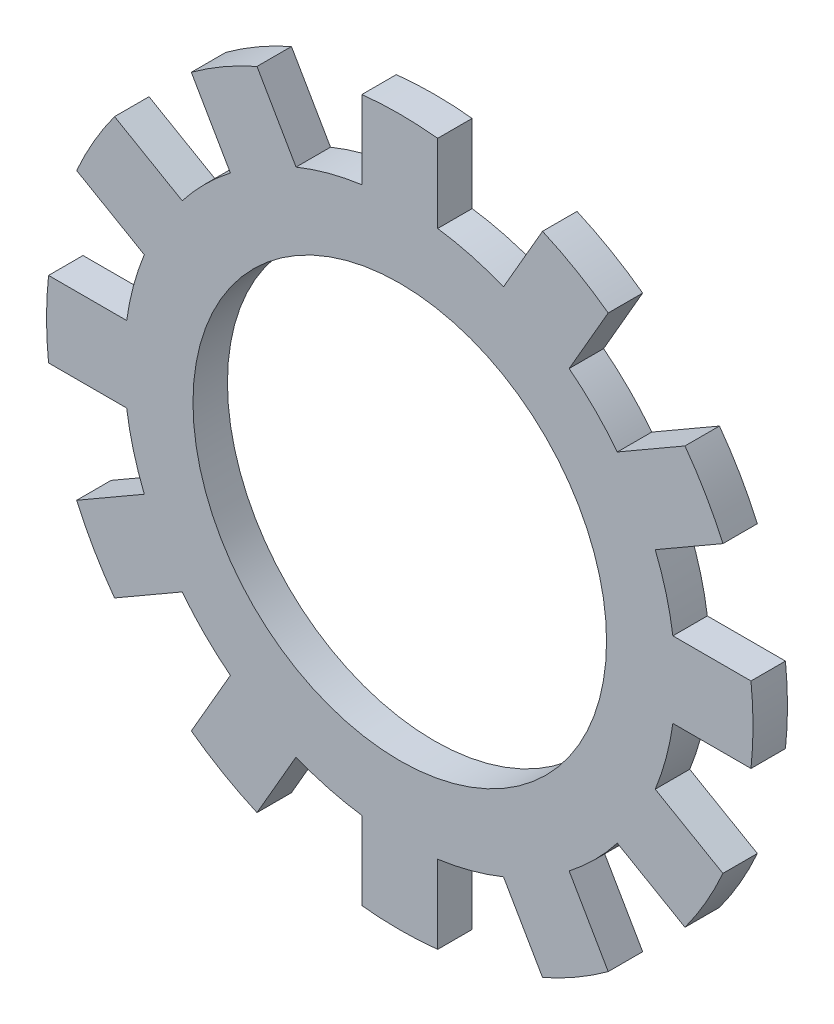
ISO-10303-21;
HEADER;
FILE_DESCRIPTION(('STEP AP214'),'2;1');
FILE_NAME('part.step','',(''),(''),'','','');
FILE_SCHEMA(('AUTOMOTIVE_DESIGN { 1 0 10303 214 1 1 1 1 }'));
ENDSEC;
DATA;
#1=APPLICATION_CONTEXT('core data for automotive mechanical design processes');
#2=APPLICATION_PROTOCOL_DEFINITION('international standard','automotive_design',2000,#1);
#3=PRODUCT_CONTEXT('',#1,'mechanical');
#4=PRODUCT('Part','Part','',(#3));
#5=PRODUCT_RELATED_PRODUCT_CATEGORY('part','',(#4));
#6=PRODUCT_DEFINITION_FORMATION('','',#4);
#7=PRODUCT_DEFINITION_CONTEXT('part definition',#1,'design');
#8=PRODUCT_DEFINITION('design','',#6,#7);
#9=PRODUCT_DEFINITION_SHAPE('','',#8);
#10=(LENGTH_UNIT() NAMED_UNIT(*) SI_UNIT(.MILLI.,.METRE.));
#11=(NAMED_UNIT(*) PLANE_ANGLE_UNIT() SI_UNIT($,.RADIAN.));
#12=(NAMED_UNIT(*) SI_UNIT($,.STERADIAN.) SOLID_ANGLE_UNIT());
#13=UNCERTAINTY_MEASURE_WITH_UNIT(LENGTH_MEASURE(1.E-05),#10,'distance_accuracy_value','');
#14=(GEOMETRIC_REPRESENTATION_CONTEXT(3) GLOBAL_UNCERTAINTY_ASSIGNED_CONTEXT((#13)) GLOBAL_UNIT_ASSIGNED_CONTEXT((#10,
#11,#12)) REPRESENTATION_CONTEXT('',''));
#15=CARTESIAN_POINT('',(0.,0.,0.));
#16=DIRECTION('',(0.,0.,1.));
#17=DIRECTION('',(1.,0.,0.));
#18=AXIS2_PLACEMENT_3D('',#15,#16,#17);
#19=CARTESIAN_POINT('',(0.,0.,0.5));
#20=DIRECTION('',(0.,0.,-1.));
#21=DIRECTION('',(-1.,0.,0.));
#22=AXIS2_PLACEMENT_3D('',#19,#20,#21);
#23=CYLINDRICAL_SURFACE('',#22,8.);
#24=CARTESIAN_POINT('',(0.,0.,-0.5));
#25=DIRECTION('',(0.,0.,1.));
#26=DIRECTION('',(1.,0.,0.));
#27=AXIS2_PLACEMENT_3D('',#24,#25,#26);
#28=CIRCLE('',#27,8.);
#29=CARTESIAN_POINT('',(6.31239754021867,4.91463501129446,-0.5));
#30=VERTEX_POINT('',#29);
#31=CARTESIAN_POINT('',(4.91463501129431,6.31239754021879,-0.5));
#32=VERTEX_POINT('',#31);
#33=EDGE_CURVE('E361',#30,#32,#28,.T.);
#34=ORIENTED_EDGE('',*,*,#33,.T.);
#35=DIRECTION('',(0.,0.,-1.));
#36=VECTOR('',#35,1.);
#37=CARTESIAN_POINT('',(4.91463501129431,6.31239754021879,0.5));
#38=LINE('',#37,#36);
#39=CARTESIAN_POINT('',(4.91463501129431,6.31239754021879,0.5));
#40=VERTEX_POINT('',#39);
#41=EDGE_CURVE('E352',#40,#32,#38,.T.);
#42=ORIENTED_EDGE('',*,*,#41,.F.);
#43=CARTESIAN_POINT('',(0.,0.,0.5));
#44=DIRECTION('',(0.,0.,1.));
#45=DIRECTION('',(1.,0.,0.));
#46=AXIS2_PLACEMENT_3D('',#43,#44,#45);
#47=CIRCLE('',#46,8.);
#48=CARTESIAN_POINT('',(6.31239754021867,4.91463501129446,0.5));
#49=VERTEX_POINT('',#48);
#50=EDGE_CURVE('E64',#49,#40,#47,.T.);
#51=ORIENTED_EDGE('',*,*,#50,.F.);
#52=DIRECTION('',(0.,0.,-1.));
#53=VECTOR('',#52,1.);
#54=CARTESIAN_POINT('',(6.31239754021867,4.91463501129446,0.5));
#55=LINE('',#54,#53);
#56=EDGE_CURVE('E627',#49,#30,#55,.T.);
#57=ORIENTED_EDGE('',*,*,#56,.T.);
#58=EDGE_LOOP('',(#34,#42,#51,#57));
#59=FACE_BOUND('',#58,.T.);
#60=ADVANCED_FACE('F39',(#59),#23,.T.);
#61=DIRECTION('',(0.,0.,-1.));
#62=VECTOR('',#61,1.);
#63=CARTESIAN_POINT('',(3.00937912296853,7.41239754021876,0.5));
#64=LINE('',#63,#62);
#65=CARTESIAN_POINT('',(3.00937912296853,7.41239754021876,0.5));
#66=VERTEX_POINT('',#65);
#67=CARTESIAN_POINT('',(3.00937912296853,7.41239754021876,-0.5));
#68=VERTEX_POINT('',#67);
#69=EDGE_CURVE('E646',#66,#68,#64,.T.);
#70=ORIENTED_EDGE('',*,*,#69,.T.);
#71=CARTESIAN_POINT('',(1.1,7.92401413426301,-0.5));
#72=VERTEX_POINT('',#71);
#73=EDGE_CURVE('E387',#68,#72,#28,.T.);
#74=ORIENTED_EDGE('',*,*,#73,.T.);
#75=DIRECTION('',(0.,0.,-1.));
#76=VECTOR('',#75,1.);
#77=CARTESIAN_POINT('',(1.1,7.92401413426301,0.5));
#78=LINE('',#77,#76);
#79=CARTESIAN_POINT('',(1.1,7.92401413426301,0.5));
#80=VERTEX_POINT('',#79);
#81=EDGE_CURVE('E404',#80,#72,#78,.T.);
#82=ORIENTED_EDGE('',*,*,#81,.F.);
#83=EDGE_CURVE('E50',#66,#80,#47,.T.);
#84=ORIENTED_EDGE('',*,*,#83,.F.);
#85=EDGE_LOOP('',(#70,#74,#82,#84));
#86=FACE_BOUND('',#85,.T.);
#87=ADVANCED_FACE('F817',(#86),#23,.T.);
#88=CARTESIAN_POINT('',(7.924014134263,1.10000000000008,-0.5));
#89=VERTEX_POINT('',#88);
#90=CARTESIAN_POINT('',(7.41239754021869,3.00937912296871,-0.5));
#91=VERTEX_POINT('',#90);
#92=EDGE_CURVE('E905',#89,#91,#28,.T.);
#93=ORIENTED_EDGE('',*,*,#92,.T.);
#94=DIRECTION('',(0.,0.,-1.));
#95=VECTOR('',#94,1.);
#96=CARTESIAN_POINT('',(7.41239754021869,3.00937912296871,0.5));
#97=LINE('',#96,#95);
#98=CARTESIAN_POINT('',(7.41239754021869,3.00937912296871,0.5));
#99=VERTEX_POINT('',#98);
#100=EDGE_CURVE('E786',#99,#91,#97,.T.);
#101=ORIENTED_EDGE('',*,*,#100,.F.);
#102=CARTESIAN_POINT('',(7.924014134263,1.10000000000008,0.5));
#103=VERTEX_POINT('',#102);
#104=EDGE_CURVE('E371',#103,#99,#47,.T.);
#105=ORIENTED_EDGE('',*,*,#104,.F.);
#106=DIRECTION('',(0.,0.,-1.));
#107=VECTOR('',#106,1.);
#108=CARTESIAN_POINT('',(7.924014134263,1.10000000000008,0.5));
#109=LINE('',#108,#107);
#110=EDGE_CURVE('E605',#103,#89,#109,.T.);
#111=ORIENTED_EDGE('',*,*,#110,.T.);
#112=EDGE_LOOP('',(#93,#101,#105,#111));
#113=FACE_BOUND('',#112,.T.);
#114=ADVANCED_FACE('F903',(#113),#23,.T.);
#115=CARTESIAN_POINT('',(7.41239754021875,-3.00937912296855,-0.5));
#116=VERTEX_POINT('',#115);
#117=CARTESIAN_POINT('',(7.92401413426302,-1.09999999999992,-0.5));
#118=VERTEX_POINT('',#117);
#119=EDGE_CURVE('E886',#116,#118,#28,.T.);
#120=ORIENTED_EDGE('',*,*,#119,.T.);
#121=DIRECTION('',(0.,0.,-1.));
#122=VECTOR('',#121,1.);
#123=CARTESIAN_POINT('',(7.92401413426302,-1.09999999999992,0.5));
#124=LINE('',#123,#122);
#125=CARTESIAN_POINT('',(7.92401413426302,-1.09999999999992,0.5));
#126=VERTEX_POINT('',#125);
#127=EDGE_CURVE('E772',#126,#118,#124,.T.);
#128=ORIENTED_EDGE('',*,*,#127,.F.);
#129=CARTESIAN_POINT('',(7.41239754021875,-3.00937912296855,0.5));
#130=VERTEX_POINT('',#129);
#131=EDGE_CURVE('E375',#130,#126,#47,.T.);
#132=ORIENTED_EDGE('',*,*,#131,.F.);
#133=DIRECTION('',(0.,0.,-1.));
#134=VECTOR('',#133,1.);
#135=CARTESIAN_POINT('',(7.41239754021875,-3.00937912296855,0.5));
#136=LINE('',#135,#134);
#137=EDGE_CURVE('E583',#130,#116,#136,.T.);
#138=ORIENTED_EDGE('',*,*,#137,.T.);
#139=EDGE_LOOP('',(#120,#128,#132,#138));
#140=FACE_BOUND('',#139,.T.);
#141=ADVANCED_FACE('F885',(#140),#23,.T.);
#142=CARTESIAN_POINT('',(4.91463501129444,-6.31239754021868,-0.5));
#143=VERTEX_POINT('',#142);
#144=CARTESIAN_POINT('',(6.31239754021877,-4.91463501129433,-0.5));
#145=VERTEX_POINT('',#144);
#146=EDGE_CURVE('E965',#143,#145,#28,.T.);
#147=ORIENTED_EDGE('',*,*,#146,.T.);
#148=DIRECTION('',(0.,0.,-1.));
#149=VECTOR('',#148,1.);
#150=CARTESIAN_POINT('',(6.31239754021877,-4.91463501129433,0.5));
#151=LINE('',#150,#149);
#152=CARTESIAN_POINT('',(6.31239754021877,-4.91463501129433,0.5));
#153=VERTEX_POINT('',#152);
#154=EDGE_CURVE('E758',#153,#145,#151,.T.);
#155=ORIENTED_EDGE('',*,*,#154,.F.);
#156=CARTESIAN_POINT('',(4.91463501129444,-6.31239754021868,0.5));
#157=VERTEX_POINT('',#156);
#158=EDGE_CURVE('E872',#157,#153,#47,.T.);
#159=ORIENTED_EDGE('',*,*,#158,.F.);
#160=DIRECTION('',(0.,0.,-1.));
#161=VECTOR('',#160,1.);
#162=CARTESIAN_POINT('',(4.91463501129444,-6.31239754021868,0.5));
#163=LINE('',#162,#161);
#164=EDGE_CURVE('E561',#157,#143,#163,.T.);
#165=ORIENTED_EDGE('',*,*,#164,.T.);
#166=EDGE_LOOP('',(#147,#155,#159,#165));
#167=FACE_BOUND('',#166,.T.);
#168=ADVANCED_FACE('F974',(#167),#23,.T.);
#169=CARTESIAN_POINT('',(1.1,-7.92401413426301,-0.5));
#170=VERTEX_POINT('',#169);
#171=CARTESIAN_POINT('',(3.00937912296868,-7.4123975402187,-0.5));
#172=VERTEX_POINT('',#171);
#173=EDGE_CURVE('E960',#170,#172,#28,.T.);
#174=ORIENTED_EDGE('',*,*,#173,.T.);
#175=DIRECTION('',(0.,0.,-1.));
#176=VECTOR('',#175,1.);
#177=CARTESIAN_POINT('',(3.00937912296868,-7.4123975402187,0.5));
#178=LINE('',#177,#176);
#179=CARTESIAN_POINT('',(3.00937912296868,-7.4123975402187,0.5));
#180=VERTEX_POINT('',#179);
#181=EDGE_CURVE('E744',#180,#172,#178,.T.);
#182=ORIENTED_EDGE('',*,*,#181,.F.);
#183=CARTESIAN_POINT('',(1.1,-7.92401413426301,0.5));
#184=VERTEX_POINT('',#183);
#185=EDGE_CURVE('E868',#184,#180,#47,.T.);
#186=ORIENTED_EDGE('',*,*,#185,.F.);
#187=DIRECTION('',(0.,0.,-1.));
#188=VECTOR('',#187,1.);
#189=CARTESIAN_POINT('',(1.1,-7.92401413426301,0.5));
#190=LINE('',#189,#188);
#191=EDGE_CURVE('E539',#184,#170,#190,.T.);
#192=ORIENTED_EDGE('',*,*,#191,.T.);
#193=EDGE_LOOP('',(#174,#182,#186,#192));
#194=FACE_BOUND('',#193,.T.);
#195=ADVANCED_FACE('F1402',(#194),#23,.T.);
#196=CARTESIAN_POINT('',(-3.00937912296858,-7.41239754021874,-0.5));
#197=VERTEX_POINT('',#196);
#198=CARTESIAN_POINT('',(-1.1,-7.92401413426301,-0.5));
#199=VERTEX_POINT('',#198);
#200=EDGE_CURVE('E955',#197,#199,#28,.T.);
#201=ORIENTED_EDGE('',*,*,#200,.T.);
#202=DIRECTION('',(0.,0.,-1.));
#203=VECTOR('',#202,1.);
#204=CARTESIAN_POINT('',(-1.1,-7.92401413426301,0.5));
#205=LINE('',#204,#203);
#206=CARTESIAN_POINT('',(-1.1,-7.92401413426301,0.5));
#207=VERTEX_POINT('',#206);
#208=EDGE_CURVE('E730',#207,#199,#205,.T.);
#209=ORIENTED_EDGE('',*,*,#208,.F.);
#210=CARTESIAN_POINT('',(-3.00937912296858,-7.41239754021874,0.5));
#211=VERTEX_POINT('',#210);
#212=EDGE_CURVE('E864',#211,#207,#47,.T.);
#213=ORIENTED_EDGE('',*,*,#212,.F.);
#214=DIRECTION('',(0.,0.,-1.));
#215=VECTOR('',#214,1.);
#216=CARTESIAN_POINT('',(-3.00937912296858,-7.41239754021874,0.5));
#217=LINE('',#216,#215);
#218=EDGE_CURVE('E517',#211,#197,#217,.T.);
#219=ORIENTED_EDGE('',*,*,#218,.T.);
#220=EDGE_LOOP('',(#201,#209,#213,#219));
#221=FACE_BOUND('',#220,.T.);
#222=ADVANCED_FACE('F1394',(#221),#23,.T.);
#223=CARTESIAN_POINT('',(-6.3123975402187,-4.91463501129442,-0.5));
#224=VERTEX_POINT('',#223);
#225=CARTESIAN_POINT('',(-4.91463501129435,-6.31239754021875,-0.5));
#226=VERTEX_POINT('',#225);
#227=EDGE_CURVE('E950',#224,#226,#28,.T.);
#228=ORIENTED_EDGE('',*,*,#227,.T.);
#229=DIRECTION('',(0.,0.,-1.));
#230=VECTOR('',#229,1.);
#231=CARTESIAN_POINT('',(-4.91463501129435,-6.31239754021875,0.5));
#232=LINE('',#231,#230);
#233=CARTESIAN_POINT('',(-4.91463501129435,-6.31239754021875,0.5));
#234=VERTEX_POINT('',#233);
#235=EDGE_CURVE('E716',#234,#226,#232,.T.);
#236=ORIENTED_EDGE('',*,*,#235,.F.);
#237=CARTESIAN_POINT('',(-6.3123975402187,-4.91463501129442,0.5));
#238=VERTEX_POINT('',#237);
#239=EDGE_CURVE('E860',#238,#234,#47,.T.);
#240=ORIENTED_EDGE('',*,*,#239,.F.);
#241=DIRECTION('',(0.,0.,-1.));
#242=VECTOR('',#241,1.);
#243=CARTESIAN_POINT('',(-6.3123975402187,-4.91463501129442,0.5));
#244=LINE('',#243,#242);
#245=EDGE_CURVE('E495',#238,#224,#244,.T.);
#246=ORIENTED_EDGE('',*,*,#245,.T.);
#247=EDGE_LOOP('',(#228,#236,#240,#246));
#248=FACE_BOUND('',#247,.T.);
#249=ADVANCED_FACE('F1386',(#248),#23,.T.);
#250=CARTESIAN_POINT('',(-7.92401413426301,-1.10000000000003,-0.5));
#251=VERTEX_POINT('',#250);
#252=CARTESIAN_POINT('',(-7.41239754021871,-3.00937912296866,-0.5));
#253=VERTEX_POINT('',#252);
#254=EDGE_CURVE('E947',#251,#253,#28,.T.);
#255=ORIENTED_EDGE('',*,*,#254,.T.);
#256=DIRECTION('',(0.,0.,-1.));
#257=VECTOR('',#256,1.);
#258=CARTESIAN_POINT('',(-7.41239754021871,-3.00937912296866,0.5));
#259=LINE('',#258,#257);
#260=CARTESIAN_POINT('',(-7.41239754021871,-3.00937912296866,0.5));
#261=VERTEX_POINT('',#260);
#262=EDGE_CURVE('E702',#261,#253,#259,.T.);
#263=ORIENTED_EDGE('',*,*,#262,.F.);
#264=CARTESIAN_POINT('',(-7.92401413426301,-1.10000000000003,0.5));
#265=VERTEX_POINT('',#264);
#266=EDGE_CURVE('E856',#265,#261,#47,.T.);
#267=ORIENTED_EDGE('',*,*,#266,.F.);
#268=DIRECTION('',(0.,0.,-1.));
#269=VECTOR('',#268,1.);
#270=CARTESIAN_POINT('',(-7.92401413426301,-1.10000000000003,0.5));
#271=LINE('',#270,#269);
#272=EDGE_CURVE('E473',#265,#251,#271,.T.);
#273=ORIENTED_EDGE('',*,*,#272,.T.);
#274=EDGE_LOOP('',(#255,#263,#267,#273));
#275=FACE_BOUND('',#274,.T.);
#276=ADVANCED_FACE('F938',(#275),#23,.T.);
#277=CARTESIAN_POINT('',(-7.41239754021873,3.00937912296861,-0.5));
#278=VERTEX_POINT('',#277);
#279=CARTESIAN_POINT('',(-7.92401413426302,1.09999999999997,-0.5));
#280=VERTEX_POINT('',#279);
#281=EDGE_CURVE('E943',#278,#280,#28,.T.);
#282=ORIENTED_EDGE('',*,*,#281,.T.);
#283=DIRECTION('',(0.,0.,-1.));
#284=VECTOR('',#283,1.);
#285=CARTESIAN_POINT('',(-7.92401413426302,1.09999999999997,0.5));
#286=LINE('',#285,#284);
#287=CARTESIAN_POINT('',(-7.92401413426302,1.09999999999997,0.5));
#288=VERTEX_POINT('',#287);
#289=EDGE_CURVE('E688',#288,#280,#286,.T.);
#290=ORIENTED_EDGE('',*,*,#289,.F.);
#291=CARTESIAN_POINT('',(-7.41239754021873,3.00937912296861,0.5));
#292=VERTEX_POINT('',#291);
#293=EDGE_CURVE('E852',#292,#288,#47,.T.);
#294=ORIENTED_EDGE('',*,*,#293,.F.);
#295=DIRECTION('',(0.,0.,-1.));
#296=VECTOR('',#295,1.);
#297=CARTESIAN_POINT('',(-7.41239754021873,3.00937912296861,0.5));
#298=LINE('',#297,#296);
#299=EDGE_CURVE('E451',#292,#278,#298,.T.);
#300=ORIENTED_EDGE('',*,*,#299,.T.);
#301=EDGE_LOOP('',(#282,#290,#294,#300));
#302=FACE_BOUND('',#301,.T.);
#303=ADVANCED_FACE('F934',(#302),#23,.T.);
#304=CARTESIAN_POINT('',(-4.9146350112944,6.31239754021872,-0.5));
#305=VERTEX_POINT('',#304);
#306=CARTESIAN_POINT('',(-6.31239754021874,4.91463501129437,-0.5));
#307=VERTEX_POINT('',#306);
#308=EDGE_CURVE('E941',#305,#307,#28,.T.);
#309=ORIENTED_EDGE('',*,*,#308,.T.);
#310=DIRECTION('',(0.,0.,-1.));
#311=VECTOR('',#310,1.);
#312=CARTESIAN_POINT('',(-6.31239754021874,4.91463501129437,0.5));
#313=LINE('',#312,#311);
#314=CARTESIAN_POINT('',(-6.31239754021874,4.91463501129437,0.5));
#315=VERTEX_POINT('',#314);
#316=EDGE_CURVE('E674',#315,#307,#313,.T.);
#317=ORIENTED_EDGE('',*,*,#316,.F.);
#318=CARTESIAN_POINT('',(-4.9146350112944,6.31239754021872,0.5));
#319=VERTEX_POINT('',#318);
#320=EDGE_CURVE('E49',#319,#315,#47,.T.);
#321=ORIENTED_EDGE('',*,*,#320,.F.);
#322=DIRECTION('',(0.,0.,-1.));
#323=VECTOR('',#322,1.);
#324=CARTESIAN_POINT('',(-4.9146350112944,6.31239754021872,0.5));
#325=LINE('',#324,#323);
#326=EDGE_CURVE('E429',#319,#305,#325,.T.);
#327=ORIENTED_EDGE('',*,*,#326,.T.);
#328=EDGE_LOOP('',(#309,#317,#321,#327));
#329=FACE_BOUND('',#328,.T.);
#330=ADVANCED_FACE('F928',(#329),#23,.T.);
#331=CARTESIAN_POINT('',(-1.1,7.92401413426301,-0.5));
#332=VERTEX_POINT('',#331);
#333=CARTESIAN_POINT('',(-3.00937912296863,7.41239754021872,-0.5));
#334=VERTEX_POINT('',#333);
#335=EDGE_CURVE('E43',#332,#334,#28,.T.);
#336=ORIENTED_EDGE('',*,*,#335,.T.);
#337=DIRECTION('',(0.,0.,-1.));
#338=VECTOR('',#337,1.);
#339=CARTESIAN_POINT('',(-3.00937912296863,7.41239754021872,0.5));
#340=LINE('',#339,#338);
#341=CARTESIAN_POINT('',(-3.00937912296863,7.41239754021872,0.5));
#342=VERTEX_POINT('',#341);
#343=EDGE_CURVE('E658',#342,#334,#340,.T.);
#344=ORIENTED_EDGE('',*,*,#343,.F.);
#345=CARTESIAN_POINT('',(-1.1,7.92401413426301,0.5));
#346=VERTEX_POINT('',#345);
#347=EDGE_CURVE('E11',#346,#342,#47,.T.);
#348=ORIENTED_EDGE('',*,*,#347,.F.);
#349=DIRECTION('',(0.,0.,-1.));
#350=VECTOR('',#349,1.);
#351=CARTESIAN_POINT('',(-1.1,7.92401413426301,0.5));
#352=LINE('',#351,#350);
#353=EDGE_CURVE('E391',#346,#332,#352,.T.);
#354=ORIENTED_EDGE('',*,*,#353,.T.);
#355=EDGE_LOOP('',(#336,#344,#348,#354));
#356=FACE_BOUND('',#355,.T.);
#357=ADVANCED_FACE('F41',(#356),#23,.T.);
#358=CARTESIAN_POINT('',(0.,0.,0.5));
#359=DIRECTION('',(0.,0.,1.));
#360=DIRECTION('',(1.,0.,0.));
#361=AXIS2_PLACEMENT_3D('',#358,#359,#360);
#362=PLANE('',#361);
#363=ORIENTED_EDGE('',*,*,#347,.T.);
#364=DIRECTION('',(0.500000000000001,-0.866025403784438,0.));
#365=VECTOR('',#364,1.);
#366=CARTESIAN_POINT('',(-4.14277439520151,9.37549573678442,0.5));
#367=LINE('',#366,#365);
#368=CARTESIAN_POINT('',(-4.14277439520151,9.37549573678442,0.5));
#369=VERTEX_POINT('',#368);
#370=EDGE_CURVE('E669',#369,#342,#367,.T.);
#371=ORIENTED_EDGE('',*,*,#370,.F.);
#372=CARTESIAN_POINT('',(0.,0.,0.5));
#373=DIRECTION('',(0.,0.,1.));
#374=DIRECTION('',(0.866025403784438,0.500000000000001,0.));
#375=AXIS2_PLACEMENT_3D('',#372,#373,#374);
#376=CIRCLE('',#375,10.25);
#377=CARTESIAN_POINT('',(-6.04803028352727,8.27549573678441,0.5));
#378=VERTEX_POINT('',#377);
#379=EDGE_CURVE('E438',#369,#378,#376,.T.);
#380=ORIENTED_EDGE('',*,*,#379,.T.);
#381=DIRECTION('',(0.500000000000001,-0.866025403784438,0.));
#382=VECTOR('',#381,1.);
#383=CARTESIAN_POINT('',(-6.04803028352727,8.27549573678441,0.5));
#384=LINE('',#383,#382);
#385=EDGE_CURVE('E433',#378,#319,#384,.T.);
#386=ORIENTED_EDGE('',*,*,#385,.T.);
#387=ORIENTED_EDGE('',*,*,#320,.T.);
#388=DIRECTION('',(0.86602540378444,-0.499999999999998,0.));
#389=VECTOR('',#388,1.);
#390=CARTESIAN_POINT('',(-8.27549573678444,6.04803028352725,0.5));
#391=LINE('',#390,#389);
#392=CARTESIAN_POINT('',(-8.27549573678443,6.04803028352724,0.5));
#393=VERTEX_POINT('',#392);
#394=EDGE_CURVE('E683',#393,#315,#391,.T.);
#395=ORIENTED_EDGE('',*,*,#394,.F.);
#396=CARTESIAN_POINT('',(0.,0.,0.5));
#397=DIRECTION('',(0.,0.,1.));
#398=DIRECTION('',(0.499999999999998,0.86602540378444,0.));
#399=AXIS2_PLACEMENT_3D('',#396,#397,#398);
#400=CIRCLE('',#399,10.25);
#401=CARTESIAN_POINT('',(-9.37549573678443,4.14277439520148,0.5));
#402=VERTEX_POINT('',#401);
#403=EDGE_CURVE('E460',#393,#402,#400,.T.);
#404=ORIENTED_EDGE('',*,*,#403,.T.);
#405=DIRECTION('',(0.86602540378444,-0.499999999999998,0.));
#406=VECTOR('',#405,1.);
#407=CARTESIAN_POINT('',(-9.37549573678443,4.14277439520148,0.5));
#408=LINE('',#407,#406);
#409=EDGE_CURVE('E455',#402,#292,#408,.T.);
#410=ORIENTED_EDGE('',*,*,#409,.T.);
#411=ORIENTED_EDGE('',*,*,#293,.T.);
#412=DIRECTION('',(1.,0.,0.));
#413=VECTOR('',#412,1.);
#414=CARTESIAN_POINT('',(-10.1908046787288,1.09999999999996,0.5));
#415=LINE('',#414,#413);
#416=CARTESIAN_POINT('',(-10.1908046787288,1.09999999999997,0.5));
#417=VERTEX_POINT('',#416);
#418=EDGE_CURVE('E697',#417,#288,#415,.T.);
#419=ORIENTED_EDGE('',*,*,#418,.F.);
#420=CARTESIAN_POINT('',(0.,0.,0.5));
#421=DIRECTION('',(0.,0.,1.));
#422=DIRECTION('',(0.,1.,0.));
#423=AXIS2_PLACEMENT_3D('',#420,#421,#422);
#424=CIRCLE('',#423,10.25);
#425=CARTESIAN_POINT('',(-10.1908046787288,-1.10000000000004,0.5));
#426=VERTEX_POINT('',#425);
#427=EDGE_CURVE('E482',#417,#426,#424,.T.);
#428=ORIENTED_EDGE('',*,*,#427,.T.);
#429=DIRECTION('',(1.,0.,0.));
#430=VECTOR('',#429,1.);
#431=CARTESIAN_POINT('',(-10.1908046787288,-1.10000000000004,0.5));
#432=LINE('',#431,#430);
#433=EDGE_CURVE('E477',#426,#265,#432,.T.);
#434=ORIENTED_EDGE('',*,*,#433,.T.);
#435=ORIENTED_EDGE('',*,*,#266,.T.);
#436=DIRECTION('',(0.866025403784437,0.500000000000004,0.));
#437=VECTOR('',#436,1.);
#438=CARTESIAN_POINT('',(-9.3754957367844,-4.14277439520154,0.5));
#439=LINE('',#438,#437);
#440=CARTESIAN_POINT('',(-9.3754957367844,-4.14277439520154,0.5));
#441=VERTEX_POINT('',#440);
#442=EDGE_CURVE('E711',#441,#261,#439,.T.);
#443=ORIENTED_EDGE('',*,*,#442,.F.);
#444=CARTESIAN_POINT('',(0.,0.,0.5));
#445=DIRECTION('',(0.,0.,1.));
#446=DIRECTION('',(-0.500000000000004,0.866025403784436,0.));
#447=AXIS2_PLACEMENT_3D('',#444,#445,#446);
#448=CIRCLE('',#447,10.25);
#449=CARTESIAN_POINT('',(-8.27549573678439,-6.0480302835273,0.5));
#450=VERTEX_POINT('',#449);
#451=EDGE_CURVE('E504',#441,#450,#448,.T.);
#452=ORIENTED_EDGE('',*,*,#451,.T.);
#453=DIRECTION('',(0.866025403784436,0.500000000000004,0.));
#454=VECTOR('',#453,1.);
#455=CARTESIAN_POINT('',(-8.27549573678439,-6.0480302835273,0.5));
#456=LINE('',#455,#454);
#457=EDGE_CURVE('E499',#450,#238,#456,.T.);
#458=ORIENTED_EDGE('',*,*,#457,.T.);
#459=ORIENTED_EDGE('',*,*,#239,.T.);
#460=DIRECTION('',(0.499999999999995,0.866025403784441,0.));
#461=VECTOR('',#460,1.);
#462=CARTESIAN_POINT('',(-6.04803028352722,-8.27549573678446,0.5));
#463=LINE('',#462,#461);
#464=CARTESIAN_POINT('',(-6.04803028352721,-8.27549573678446,0.5));
#465=VERTEX_POINT('',#464);
#466=EDGE_CURVE('E725',#465,#234,#463,.T.);
#467=ORIENTED_EDGE('',*,*,#466,.F.);
#468=CARTESIAN_POINT('',(0.,0.,0.5));
#469=DIRECTION('',(0.,0.,1.));
#470=DIRECTION('',(-0.866025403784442,0.499999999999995,0.));
#471=AXIS2_PLACEMENT_3D('',#468,#469,#470);
#472=CIRCLE('',#471,10.25);
#473=CARTESIAN_POINT('',(-4.14277439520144,-9.37549573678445,0.5));
#474=VERTEX_POINT('',#473);
#475=EDGE_CURVE('E526',#465,#474,#472,.T.);
#476=ORIENTED_EDGE('',*,*,#475,.T.);
#477=DIRECTION('',(0.499999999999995,0.866025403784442,0.));
#478=VECTOR('',#477,1.);
#479=CARTESIAN_POINT('',(-4.14277439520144,-9.37549573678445,0.5));
#480=LINE('',#479,#478);
#481=EDGE_CURVE('E521',#474,#211,#480,.T.);
#482=ORIENTED_EDGE('',*,*,#481,.T.);
#483=ORIENTED_EDGE('',*,*,#212,.T.);
#484=DIRECTION('',(0.,1.,0.));
#485=VECTOR('',#484,1.);
#486=CARTESIAN_POINT('',(-1.1,-10.1908046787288,0.5));
#487=LINE('',#486,#485);
#488=CARTESIAN_POINT('',(-1.1,-10.1908046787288,0.5));
#489=VERTEX_POINT('',#488);
#490=EDGE_CURVE('E739',#489,#207,#487,.T.);
#491=ORIENTED_EDGE('',*,*,#490,.F.);
#492=CARTESIAN_POINT('',(0.,0.,0.5));
#493=DIRECTION('',(0.,0.,1.));
#494=DIRECTION('',(-1.,0.,0.));
#495=AXIS2_PLACEMENT_3D('',#492,#493,#494);
#496=CIRCLE('',#495,10.25);
#497=CARTESIAN_POINT('',(1.1,-10.1908046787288,0.5));
#498=VERTEX_POINT('',#497);
#499=EDGE_CURVE('E548',#489,#498,#496,.T.);
#500=ORIENTED_EDGE('',*,*,#499,.T.);
#501=DIRECTION('',(0.,1.,0.));
#502=VECTOR('',#501,1.);
#503=CARTESIAN_POINT('',(1.1,-10.1908046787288,0.5));
#504=LINE('',#503,#502);
#505=EDGE_CURVE('E543',#498,#184,#504,.T.);
#506=ORIENTED_EDGE('',*,*,#505,.T.);
#507=ORIENTED_EDGE('',*,*,#185,.T.);
#508=DIRECTION('',(-0.500000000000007,0.866025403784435,0.));
#509=VECTOR('',#508,1.);
#510=CARTESIAN_POINT('',(4.14277439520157,-9.37549573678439,0.5));
#511=LINE('',#510,#509);
#512=CARTESIAN_POINT('',(4.14277439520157,-9.37549573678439,0.5));
#513=VERTEX_POINT('',#512);
#514=EDGE_CURVE('E753',#513,#180,#511,.T.);
#515=ORIENTED_EDGE('',*,*,#514,.F.);
#516=CARTESIAN_POINT('',(0.,0.,0.5));
#517=DIRECTION('',(0.,0.,1.));
#518=DIRECTION('',(-0.866025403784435,-0.500000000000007,0.));
#519=AXIS2_PLACEMENT_3D('',#516,#517,#518);
#520=CIRCLE('',#519,10.25);
#521=CARTESIAN_POINT('',(6.04803028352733,-8.27549573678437,0.5));
#522=VERTEX_POINT('',#521);
#523=EDGE_CURVE('E570',#513,#522,#520,.T.);
#524=ORIENTED_EDGE('',*,*,#523,.T.);
#525=DIRECTION('',(-0.500000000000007,0.866025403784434,0.));
#526=VECTOR('',#525,1.);
#527=CARTESIAN_POINT('',(6.04803028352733,-8.27549573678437,0.5));
#528=LINE('',#527,#526);
#529=EDGE_CURVE('E565',#522,#157,#528,.T.);
#530=ORIENTED_EDGE('',*,*,#529,.T.);
#531=ORIENTED_EDGE('',*,*,#158,.T.);
#532=DIRECTION('',(-0.866025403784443,0.499999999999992,0.));
#533=VECTOR('',#532,1.);
#534=CARTESIAN_POINT('',(8.27549573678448,-6.04803028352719,0.5));
#535=LINE('',#534,#533);
#536=CARTESIAN_POINT('',(8.27549573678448,-6.04803028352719,0.5));
#537=VERTEX_POINT('',#536);
#538=EDGE_CURVE('E767',#537,#153,#535,.T.);
#539=ORIENTED_EDGE('',*,*,#538,.F.);
#540=CARTESIAN_POINT('',(0.,0.,0.5));
#541=DIRECTION('',(0.,0.,1.));
#542=DIRECTION('',(-0.499999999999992,-0.866025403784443,0.));
#543=AXIS2_PLACEMENT_3D('',#540,#541,#542);
#544=CIRCLE('',#543,10.25);
#545=CARTESIAN_POINT('',(9.37549573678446,-4.14277439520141,0.5));
#546=VERTEX_POINT('',#545);
#547=EDGE_CURVE('E592',#537,#546,#544,.T.);
#548=ORIENTED_EDGE('',*,*,#547,.T.);
#549=DIRECTION('',(-0.866025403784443,0.499999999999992,0.));
#550=VECTOR('',#549,1.);
#551=CARTESIAN_POINT('',(9.37549573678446,-4.14277439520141,0.5));
#552=LINE('',#551,#550);
#553=EDGE_CURVE('E587',#546,#130,#552,.T.);
#554=ORIENTED_EDGE('',*,*,#553,.T.);
#555=ORIENTED_EDGE('',*,*,#131,.T.);
#556=DIRECTION('',(-1.,0.,0.));
#557=VECTOR('',#556,1.);
#558=CARTESIAN_POINT('',(10.1908046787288,-1.09999999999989,0.5));
#559=LINE('',#558,#557);
#560=CARTESIAN_POINT('',(10.1908046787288,-1.09999999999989,0.5));
#561=VERTEX_POINT('',#560);
#562=EDGE_CURVE('E781',#561,#126,#559,.T.);
#563=ORIENTED_EDGE('',*,*,#562,.F.);
#564=CARTESIAN_POINT('',(0.,0.,0.5));
#565=DIRECTION('',(0.,0.,1.));
#566=DIRECTION('',(0.,-1.,0.));
#567=AXIS2_PLACEMENT_3D('',#564,#565,#566);
#568=CIRCLE('',#567,10.25);
#569=CARTESIAN_POINT('',(10.1908046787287,1.10000000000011,0.5));
#570=VERTEX_POINT('',#569);
#571=EDGE_CURVE('E614',#561,#570,#568,.T.);
#572=ORIENTED_EDGE('',*,*,#571,.T.);
#573=DIRECTION('',(-1.,0.,0.));
#574=VECTOR('',#573,1.);
#575=CARTESIAN_POINT('',(10.1908046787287,1.10000000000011,0.5));
#576=LINE('',#575,#574);
#577=EDGE_CURVE('E609',#570,#103,#576,.T.);
#578=ORIENTED_EDGE('',*,*,#577,.T.);
#579=ORIENTED_EDGE('',*,*,#104,.T.);
#580=DIRECTION('',(-0.866025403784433,-0.50000000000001,0.));
#581=VECTOR('',#580,1.);
#582=CARTESIAN_POINT('',(9.37549573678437,4.14277439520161,0.5));
#583=LINE('',#582,#581);
#584=CARTESIAN_POINT('',(9.37549573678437,4.14277439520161,0.5));
#585=VERTEX_POINT('',#584);
#586=EDGE_CURVE('E795',#585,#99,#583,.T.);
#587=ORIENTED_EDGE('',*,*,#586,.F.);
#588=CARTESIAN_POINT('',(0.,0.,0.5));
#589=DIRECTION('',(0.,0.,1.));
#590=DIRECTION('',(0.50000000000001,-0.866025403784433,0.));
#591=AXIS2_PLACEMENT_3D('',#588,#589,#590);
#592=CIRCLE('',#591,10.25);
#593=CARTESIAN_POINT('',(8.27549573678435,6.04803028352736,0.5));
#594=VERTEX_POINT('',#593);
#595=EDGE_CURVE('E634',#585,#594,#592,.T.);
#596=ORIENTED_EDGE('',*,*,#595,.T.);
#597=DIRECTION('',(-0.866025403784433,-0.50000000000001,0.));
#598=VECTOR('',#597,1.);
#599=CARTESIAN_POINT('',(8.27549573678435,6.04803028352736,0.5));
#600=LINE('',#599,#598);
#601=EDGE_CURVE('E368',#594,#49,#600,.T.);
#602=ORIENTED_EDGE('',*,*,#601,.T.);
#603=ORIENTED_EDGE('',*,*,#50,.T.);
#604=DIRECTION('',(-0.499999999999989,-0.866025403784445,0.));
#605=VECTOR('',#604,1.);
#606=CARTESIAN_POINT('',(6.04803028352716,8.2754957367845,0.5));
#607=LINE('',#606,#605);
#608=CARTESIAN_POINT('',(6.04803028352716,8.2754957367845,0.5));
#609=VERTEX_POINT('',#608);
#610=EDGE_CURVE('E349',#609,#40,#607,.T.);
#611=ORIENTED_EDGE('',*,*,#610,.F.);
#612=CARTESIAN_POINT('',(0.,0.,0.5));
#613=DIRECTION('',(0.,0.,1.));
#614=DIRECTION('',(0.866025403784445,-0.499999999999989,0.));
#615=AXIS2_PLACEMENT_3D('',#612,#613,#614);
#616=CIRCLE('',#615,10.25);
#617=CARTESIAN_POINT('',(4.14277439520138,9.37549573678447,0.5));
#618=VERTEX_POINT('',#617);
#619=EDGE_CURVE('E654',#609,#618,#616,.T.);
#620=ORIENTED_EDGE('',*,*,#619,.T.);
#621=DIRECTION('',(-0.499999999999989,-0.866025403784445,0.));
#622=VECTOR('',#621,1.);
#623=CARTESIAN_POINT('',(4.14277439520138,9.37549573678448,0.5));
#624=LINE('',#623,#622);
#625=EDGE_CURVE('E649',#618,#66,#624,.T.);
#626=ORIENTED_EDGE('',*,*,#625,.T.);
#627=ORIENTED_EDGE('',*,*,#83,.T.);
#628=DIRECTION('',(0.,-1.,0.));
#629=VECTOR('',#628,1.);
#630=CARTESIAN_POINT('',(1.1,10.1908046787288,0.5));
#631=LINE('',#630,#629);
#632=CARTESIAN_POINT('',(1.1,10.1908046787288,0.5));
#633=VERTEX_POINT('',#632);
#634=EDGE_CURVE('E417',#633,#80,#631,.T.);
#635=ORIENTED_EDGE('',*,*,#634,.F.);
#636=CARTESIAN_POINT('',(0.,0.,0.5));
#637=DIRECTION('',(0.,0.,1.));
#638=DIRECTION('',(1.,0.,0.));
#639=AXIS2_PLACEMENT_3D('',#636,#637,#638);
#640=CIRCLE('',#639,10.25);
#641=CARTESIAN_POINT('',(-1.1,10.1908046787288,0.5));
#642=VERTEX_POINT('',#641);
#643=EDGE_CURVE('E400',#633,#642,#640,.T.);
#644=ORIENTED_EDGE('',*,*,#643,.T.);
#645=DIRECTION('',(0.,-1.,0.));
#646=VECTOR('',#645,1.);
#647=CARTESIAN_POINT('',(-1.1,10.1908046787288,0.5));
#648=LINE('',#647,#646);
#649=EDGE_CURVE('E395',#642,#346,#648,.T.);
#650=ORIENTED_EDGE('',*,*,#649,.T.);
#651=EDGE_LOOP('',(#363,#371,#380,#386,#387,#395,#404,#410,#411,#419,#428,#434,#435,#443,#452,
#458,#459,#467,#476,#482,#483,#491,#500,#506,#507,#515,#524,#530,#531,#539,#548,#554,#555,#563,
#572,#578,#579,#587,#596,#602,#603,#611,#620,#626,#627,#635,#644,#650));
#652=FACE_BOUND('',#651,.T.);
#653=CARTESIAN_POINT('',(0.,0.,0.5));
#654=DIRECTION('',(0.,0.,1.));
#655=DIRECTION('',(1.,0.,0.));
#656=AXIS2_PLACEMENT_3D('',#653,#654,#655);
#657=CIRCLE('',#656,6.);
#658=CARTESIAN_POINT('',(6.,0.,0.5));
#659=VERTEX_POINT('',#658);
#660=EDGE_CURVE('E382',#659,#659,#657,.T.);
#661=ORIENTED_EDGE('',*,*,#660,.F.);
#662=EDGE_LOOP('',(#661));
#663=FACE_BOUND('',#662,.T.);
#664=ADVANCED_FACE('F365',(#652,#663),#362,.T.);
#665=CARTESIAN_POINT('',(0.,0.,-0.5));
#666=DIRECTION('',(0.,0.,1.));
#667=DIRECTION('',(1.,0.,0.));
#668=AXIS2_PLACEMENT_3D('',#665,#666,#667);
#669=PLANE('',#668);
#670=ORIENTED_EDGE('',*,*,#335,.F.);
#671=DIRECTION('',(0.,-1.,0.));
#672=VECTOR('',#671,1.);
#673=CARTESIAN_POINT('',(-1.1,10.1908046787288,-0.5));
#674=LINE('',#673,#672);
#675=CARTESIAN_POINT('',(-1.1,10.1908046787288,-0.5));
#676=VERTEX_POINT('',#675);
#677=EDGE_CURVE('E396',#676,#332,#674,.T.);
#678=ORIENTED_EDGE('',*,*,#677,.F.);
#679=CARTESIAN_POINT('',(0.,0.,-0.5));
#680=DIRECTION('',(0.,0.,1.));
#681=DIRECTION('',(1.,0.,0.));
#682=AXIS2_PLACEMENT_3D('',#679,#680,#681);
#683=CIRCLE('',#682,10.25);
#684=CARTESIAN_POINT('',(1.1,10.1908046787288,-0.5));
#685=VERTEX_POINT('',#684);
#686=EDGE_CURVE('E401',#685,#676,#683,.T.);
#687=ORIENTED_EDGE('',*,*,#686,.F.);
#688=DIRECTION('',(0.,-1.,0.));
#689=VECTOR('',#688,1.);
#690=CARTESIAN_POINT('',(1.1,10.1908046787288,-0.5));
#691=LINE('',#690,#689);
#692=EDGE_CURVE('E418',#685,#72,#691,.T.);
#693=ORIENTED_EDGE('',*,*,#692,.T.);
#694=ORIENTED_EDGE('',*,*,#73,.F.);
#695=DIRECTION('',(-0.499999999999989,-0.866025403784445,0.));
#696=VECTOR('',#695,1.);
#697=CARTESIAN_POINT('',(4.14277439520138,9.37549573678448,-0.5));
#698=LINE('',#697,#696);
#699=CARTESIAN_POINT('',(4.14277439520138,9.37549573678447,-0.5));
#700=VERTEX_POINT('',#699);
#701=EDGE_CURVE('E650',#700,#68,#698,.T.);
#702=ORIENTED_EDGE('',*,*,#701,.F.);
#703=CARTESIAN_POINT('',(0.,0.,-0.5));
#704=DIRECTION('',(0.,0.,1.));
#705=DIRECTION('',(0.866025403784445,-0.499999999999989,0.));
#706=AXIS2_PLACEMENT_3D('',#703,#704,#705);
#707=CIRCLE('',#706,10.25);
#708=CARTESIAN_POINT('',(6.04803028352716,8.2754957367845,-0.5));
#709=VERTEX_POINT('',#708);
#710=EDGE_CURVE('E655',#709,#700,#707,.T.);
#711=ORIENTED_EDGE('',*,*,#710,.F.);
#712=DIRECTION('',(-0.499999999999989,-0.866025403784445,0.));
#713=VECTOR('',#712,1.);
#714=CARTESIAN_POINT('',(6.04803028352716,8.2754957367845,-0.5));
#715=LINE('',#714,#713);
#716=EDGE_CURVE('E358',#709,#32,#715,.T.);
#717=ORIENTED_EDGE('',*,*,#716,.T.);
#718=ORIENTED_EDGE('',*,*,#33,.F.);
#719=DIRECTION('',(-0.866025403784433,-0.50000000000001,0.));
#720=VECTOR('',#719,1.);
#721=CARTESIAN_POINT('',(8.27549573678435,6.04803028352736,-0.5));
#722=LINE('',#721,#720);
#723=CARTESIAN_POINT('',(8.27549573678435,6.04803028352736,-0.5));
#724=VERTEX_POINT('',#723);
#725=EDGE_CURVE('E630',#724,#30,#722,.T.);
#726=ORIENTED_EDGE('',*,*,#725,.F.);
#727=CARTESIAN_POINT('',(0.,0.,-0.5));
#728=DIRECTION('',(0.,0.,1.));
#729=DIRECTION('',(0.50000000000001,-0.866025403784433,0.));
#730=AXIS2_PLACEMENT_3D('',#727,#728,#729);
#731=CIRCLE('',#730,10.25);
#732=CARTESIAN_POINT('',(9.37549573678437,4.14277439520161,-0.5));
#733=VERTEX_POINT('',#732);
#734=EDGE_CURVE('E635',#733,#724,#731,.T.);
#735=ORIENTED_EDGE('',*,*,#734,.F.);
#736=DIRECTION('',(-0.866025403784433,-0.50000000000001,0.));
#737=VECTOR('',#736,1.);
#738=CARTESIAN_POINT('',(9.37549573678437,4.14277439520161,-0.5));
#739=LINE('',#738,#737);
#740=EDGE_CURVE('E363',#733,#91,#739,.T.);
#741=ORIENTED_EDGE('',*,*,#740,.T.);
#742=ORIENTED_EDGE('',*,*,#92,.F.);
#743=DIRECTION('',(-1.,0.,0.));
#744=VECTOR('',#743,1.);
#745=CARTESIAN_POINT('',(10.1908046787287,1.10000000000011,-0.5));
#746=LINE('',#745,#744);
#747=CARTESIAN_POINT('',(10.1908046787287,1.10000000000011,-0.5));
#748=VERTEX_POINT('',#747);
#749=EDGE_CURVE('E610',#748,#89,#746,.T.);
#750=ORIENTED_EDGE('',*,*,#749,.F.);
#751=CARTESIAN_POINT('',(0.,0.,-0.5));
#752=DIRECTION('',(0.,0.,1.));
#753=DIRECTION('',(0.,-1.,0.));
#754=AXIS2_PLACEMENT_3D('',#751,#752,#753);
#755=CIRCLE('',#754,10.25);
#756=CARTESIAN_POINT('',(10.1908046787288,-1.09999999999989,-0.5));
#757=VERTEX_POINT('',#756);
#758=EDGE_CURVE('E615',#757,#748,#755,.T.);
#759=ORIENTED_EDGE('',*,*,#758,.F.);
#760=DIRECTION('',(-1.,0.,0.));
#761=VECTOR('',#760,1.);
#762=CARTESIAN_POINT('',(10.1908046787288,-1.09999999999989,-0.5));
#763=LINE('',#762,#761);
#764=EDGE_CURVE('E782',#757,#118,#763,.T.);
#765=ORIENTED_EDGE('',*,*,#764,.T.);
#766=ORIENTED_EDGE('',*,*,#119,.F.);
#767=DIRECTION('',(-0.866025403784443,0.499999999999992,0.));
#768=VECTOR('',#767,1.);
#769=CARTESIAN_POINT('',(9.37549573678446,-4.14277439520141,-0.5));
#770=LINE('',#769,#768);
#771=CARTESIAN_POINT('',(9.37549573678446,-4.14277439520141,-0.5));
#772=VERTEX_POINT('',#771);
#773=EDGE_CURVE('E588',#772,#116,#770,.T.);
#774=ORIENTED_EDGE('',*,*,#773,.F.);
#775=CARTESIAN_POINT('',(0.,0.,-0.5));
#776=DIRECTION('',(0.,0.,1.));
#777=DIRECTION('',(-0.499999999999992,-0.866025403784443,0.));
#778=AXIS2_PLACEMENT_3D('',#775,#776,#777);
#779=CIRCLE('',#778,10.25);
#780=CARTESIAN_POINT('',(8.27549573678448,-6.04803028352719,-0.5));
#781=VERTEX_POINT('',#780);
#782=EDGE_CURVE('E593',#781,#772,#779,.T.);
#783=ORIENTED_EDGE('',*,*,#782,.F.);
#784=DIRECTION('',(-0.866025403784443,0.499999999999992,0.));
#785=VECTOR('',#784,1.);
#786=CARTESIAN_POINT('',(8.27549573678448,-6.04803028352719,-0.5));
#787=LINE('',#786,#785);
#788=EDGE_CURVE('E768',#781,#145,#787,.T.);
#789=ORIENTED_EDGE('',*,*,#788,.T.);
#790=ORIENTED_EDGE('',*,*,#146,.F.);
#791=DIRECTION('',(-0.500000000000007,0.866025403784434,0.));
#792=VECTOR('',#791,1.);
#793=CARTESIAN_POINT('',(6.04803028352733,-8.27549573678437,-0.5));
#794=LINE('',#793,#792);
#795=CARTESIAN_POINT('',(6.04803028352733,-8.27549573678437,-0.5));
#796=VERTEX_POINT('',#795);
#797=EDGE_CURVE('E566',#796,#143,#794,.T.);
#798=ORIENTED_EDGE('',*,*,#797,.F.);
#799=CARTESIAN_POINT('',(0.,0.,-0.5));
#800=DIRECTION('',(0.,0.,1.));
#801=DIRECTION('',(-0.866025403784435,-0.500000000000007,0.));
#802=AXIS2_PLACEMENT_3D('',#799,#800,#801);
#803=CIRCLE('',#802,10.25);
#804=CARTESIAN_POINT('',(4.14277439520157,-9.37549573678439,-0.5));
#805=VERTEX_POINT('',#804);
#806=EDGE_CURVE('E571',#805,#796,#803,.T.);
#807=ORIENTED_EDGE('',*,*,#806,.F.);
#808=DIRECTION('',(-0.500000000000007,0.866025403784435,0.));
#809=VECTOR('',#808,1.);
#810=CARTESIAN_POINT('',(4.14277439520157,-9.37549573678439,-0.5));
#811=LINE('',#810,#809);
#812=EDGE_CURVE('E754',#805,#172,#811,.T.);
#813=ORIENTED_EDGE('',*,*,#812,.T.);
#814=ORIENTED_EDGE('',*,*,#173,.F.);
#815=DIRECTION('',(0.,1.,0.));
#816=VECTOR('',#815,1.);
#817=CARTESIAN_POINT('',(1.1,-10.1908046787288,-0.5));
#818=LINE('',#817,#816);
#819=CARTESIAN_POINT('',(1.1,-10.1908046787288,-0.5));
#820=VERTEX_POINT('',#819);
#821=EDGE_CURVE('E544',#820,#170,#818,.T.);
#822=ORIENTED_EDGE('',*,*,#821,.F.);
#823=CARTESIAN_POINT('',(0.,0.,-0.5));
#824=DIRECTION('',(0.,0.,1.));
#825=DIRECTION('',(-1.,0.,0.));
#826=AXIS2_PLACEMENT_3D('',#823,#824,#825);
#827=CIRCLE('',#826,10.25);
#828=CARTESIAN_POINT('',(-1.1,-10.1908046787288,-0.5));
#829=VERTEX_POINT('',#828);
#830=EDGE_CURVE('E549',#829,#820,#827,.T.);
#831=ORIENTED_EDGE('',*,*,#830,.F.);
#832=DIRECTION('',(0.,1.,0.));
#833=VECTOR('',#832,1.);
#834=CARTESIAN_POINT('',(-1.1,-10.1908046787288,-0.5));
#835=LINE('',#834,#833);
#836=EDGE_CURVE('E740',#829,#199,#835,.T.);
#837=ORIENTED_EDGE('',*,*,#836,.T.);
#838=ORIENTED_EDGE('',*,*,#200,.F.);
#839=DIRECTION('',(0.499999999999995,0.866025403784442,0.));
#840=VECTOR('',#839,1.);
#841=CARTESIAN_POINT('',(-4.14277439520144,-9.37549573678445,-0.5));
#842=LINE('',#841,#840);
#843=CARTESIAN_POINT('',(-4.14277439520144,-9.37549573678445,-0.5));
#844=VERTEX_POINT('',#843);
#845=EDGE_CURVE('E522',#844,#197,#842,.T.);
#846=ORIENTED_EDGE('',*,*,#845,.F.);
#847=CARTESIAN_POINT('',(0.,0.,-0.5));
#848=DIRECTION('',(0.,0.,1.));
#849=DIRECTION('',(-0.866025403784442,0.499999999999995,0.));
#850=AXIS2_PLACEMENT_3D('',#847,#848,#849);
#851=CIRCLE('',#850,10.25);
#852=CARTESIAN_POINT('',(-6.04803028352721,-8.27549573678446,-0.5));
#853=VERTEX_POINT('',#852);
#854=EDGE_CURVE('E527',#853,#844,#851,.T.);
#855=ORIENTED_EDGE('',*,*,#854,.F.);
#856=DIRECTION('',(0.499999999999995,0.866025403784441,0.));
#857=VECTOR('',#856,1.);
#858=CARTESIAN_POINT('',(-6.04803028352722,-8.27549573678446,-0.5));
#859=LINE('',#858,#857);
#860=EDGE_CURVE('E726',#853,#226,#859,.T.);
#861=ORIENTED_EDGE('',*,*,#860,.T.);
#862=ORIENTED_EDGE('',*,*,#227,.F.);
#863=DIRECTION('',(0.866025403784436,0.500000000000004,0.));
#864=VECTOR('',#863,1.);
#865=CARTESIAN_POINT('',(-8.27549573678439,-6.0480302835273,-0.5));
#866=LINE('',#865,#864);
#867=CARTESIAN_POINT('',(-8.27549573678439,-6.0480302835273,-0.5));
#868=VERTEX_POINT('',#867);
#869=EDGE_CURVE('E500',#868,#224,#866,.T.);
#870=ORIENTED_EDGE('',*,*,#869,.F.);
#871=CARTESIAN_POINT('',(0.,0.,-0.5));
#872=DIRECTION('',(0.,0.,1.));
#873=DIRECTION('',(-0.500000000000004,0.866025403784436,0.));
#874=AXIS2_PLACEMENT_3D('',#871,#872,#873);
#875=CIRCLE('',#874,10.25);
#876=CARTESIAN_POINT('',(-9.3754957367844,-4.14277439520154,-0.5));
#877=VERTEX_POINT('',#876);
#878=EDGE_CURVE('E505',#877,#868,#875,.T.);
#879=ORIENTED_EDGE('',*,*,#878,.F.);
#880=DIRECTION('',(0.866025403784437,0.500000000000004,0.));
#881=VECTOR('',#880,1.);
#882=CARTESIAN_POINT('',(-9.3754957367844,-4.14277439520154,-0.5));
#883=LINE('',#882,#881);
#884=EDGE_CURVE('E712',#877,#253,#883,.T.);
#885=ORIENTED_EDGE('',*,*,#884,.T.);
#886=ORIENTED_EDGE('',*,*,#254,.F.);
#887=DIRECTION('',(1.,0.,0.));
#888=VECTOR('',#887,1.);
#889=CARTESIAN_POINT('',(-10.1908046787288,-1.10000000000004,-0.5));
#890=LINE('',#889,#888);
#891=CARTESIAN_POINT('',(-10.1908046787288,-1.10000000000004,-0.5));
#892=VERTEX_POINT('',#891);
#893=EDGE_CURVE('E478',#892,#251,#890,.T.);
#894=ORIENTED_EDGE('',*,*,#893,.F.);
#895=CARTESIAN_POINT('',(0.,0.,-0.5));
#896=DIRECTION('',(0.,0.,1.));
#897=DIRECTION('',(0.,1.,0.));
#898=AXIS2_PLACEMENT_3D('',#895,#896,#897);
#899=CIRCLE('',#898,10.25);
#900=CARTESIAN_POINT('',(-10.1908046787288,1.09999999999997,-0.5));
#901=VERTEX_POINT('',#900);
#902=EDGE_CURVE('E483',#901,#892,#899,.T.);
#903=ORIENTED_EDGE('',*,*,#902,.F.);
#904=DIRECTION('',(1.,0.,0.));
#905=VECTOR('',#904,1.);
#906=CARTESIAN_POINT('',(-10.1908046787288,1.09999999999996,-0.5));
#907=LINE('',#906,#905);
#908=EDGE_CURVE('E698',#901,#280,#907,.T.);
#909=ORIENTED_EDGE('',*,*,#908,.T.);
#910=ORIENTED_EDGE('',*,*,#281,.F.);
#911=DIRECTION('',(0.86602540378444,-0.499999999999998,0.));
#912=VECTOR('',#911,1.);
#913=CARTESIAN_POINT('',(-9.37549573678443,4.14277439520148,-0.5));
#914=LINE('',#913,#912);
#915=CARTESIAN_POINT('',(-9.37549573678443,4.14277439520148,-0.5));
#916=VERTEX_POINT('',#915);
#917=EDGE_CURVE('E456',#916,#278,#914,.T.);
#918=ORIENTED_EDGE('',*,*,#917,.F.);
#919=CARTESIAN_POINT('',(0.,0.,-0.5));
#920=DIRECTION('',(0.,0.,1.));
#921=DIRECTION('',(0.499999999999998,0.86602540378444,0.));
#922=AXIS2_PLACEMENT_3D('',#919,#920,#921);
#923=CIRCLE('',#922,10.25);
#924=CARTESIAN_POINT('',(-8.27549573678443,6.04803028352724,-0.5));
#925=VERTEX_POINT('',#924);
#926=EDGE_CURVE('E461',#925,#916,#923,.T.);
#927=ORIENTED_EDGE('',*,*,#926,.F.);
#928=DIRECTION('',(0.86602540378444,-0.499999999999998,0.));
#929=VECTOR('',#928,1.);
#930=CARTESIAN_POINT('',(-8.27549573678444,6.04803028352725,-0.5));
#931=LINE('',#930,#929);
#932=EDGE_CURVE('E684',#925,#307,#931,.T.);
#933=ORIENTED_EDGE('',*,*,#932,.T.);
#934=ORIENTED_EDGE('',*,*,#308,.F.);
#935=DIRECTION('',(0.500000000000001,-0.866025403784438,0.));
#936=VECTOR('',#935,1.);
#937=CARTESIAN_POINT('',(-6.04803028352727,8.27549573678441,-0.5));
#938=LINE('',#937,#936);
#939=CARTESIAN_POINT('',(-6.04803028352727,8.27549573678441,-0.5));
#940=VERTEX_POINT('',#939);
#941=EDGE_CURVE('E434',#940,#305,#938,.T.);
#942=ORIENTED_EDGE('',*,*,#941,.F.);
#943=CARTESIAN_POINT('',(0.,0.,-0.5));
#944=DIRECTION('',(0.,0.,1.));
#945=DIRECTION('',(0.866025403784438,0.500000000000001,0.));
#946=AXIS2_PLACEMENT_3D('',#943,#944,#945);
#947=CIRCLE('',#946,10.25);
#948=CARTESIAN_POINT('',(-4.14277439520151,9.37549573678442,-0.5));
#949=VERTEX_POINT('',#948);
#950=EDGE_CURVE('E439',#949,#940,#947,.T.);
#951=ORIENTED_EDGE('',*,*,#950,.F.);
#952=DIRECTION('',(0.500000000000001,-0.866025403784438,0.));
#953=VECTOR('',#952,1.);
#954=CARTESIAN_POINT('',(-4.14277439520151,9.37549573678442,-0.5));
#955=LINE('',#954,#953);
#956=EDGE_CURVE('E670',#949,#334,#955,.T.);
#957=ORIENTED_EDGE('',*,*,#956,.T.);
#958=EDGE_LOOP('',(#670,#678,#687,#693,#694,#702,#711,#717,#718,#726,#735,#741,#742,#750,#759,
#765,#766,#774,#783,#789,#790,#798,#807,#813,#814,#822,#831,#837,#838,#846,#855,#861,#862,#870,
#879,#885,#886,#894,#903,#909,#910,#918,#927,#933,#934,#942,#951,#957));
#959=FACE_BOUND('',#958,.T.);
#960=CARTESIAN_POINT('',(0.,0.,-0.5));
#961=DIRECTION('',(0.,0.,1.));
#962=DIRECTION('',(1.,0.,0.));
#963=AXIS2_PLACEMENT_3D('',#960,#961,#962);
#964=CIRCLE('',#963,6.);
#965=CARTESIAN_POINT('',(6.,0.,-0.5));
#966=VERTEX_POINT('',#965);
#967=EDGE_CURVE('E378',#966,#966,#964,.T.);
#968=ORIENTED_EDGE('',*,*,#967,.T.);
#969=EDGE_LOOP('',(#968));
#970=FACE_BOUND('',#969,.T.);
#971=ADVANCED_FACE('F805',(#959,#970),#669,.F.);
#972=CARTESIAN_POINT('',(0.,0.,0.5));
#973=DIRECTION('',(0.,0.,-1.));
#974=DIRECTION('',(-1.,0.,0.));
#975=AXIS2_PLACEMENT_3D('',#972,#973,#974);
#976=CYLINDRICAL_SURFACE('',#975,6.);
#977=ORIENTED_EDGE('',*,*,#660,.T.);
#978=EDGE_LOOP('',(#977));
#979=FACE_BOUND('',#978,.T.);
#980=ORIENTED_EDGE('',*,*,#967,.F.);
#981=EDGE_LOOP('',(#980));
#982=FACE_BOUND('',#981,.T.);
#983=ADVANCED_FACE('F1054',(#979,#982),#976,.F.);
#984=CARTESIAN_POINT('',(0.,0.,0.5));
#985=DIRECTION('',(0.,0.,-1.));
#986=DIRECTION('',(-1.,0.,0.));
#987=AXIS2_PLACEMENT_3D('',#984,#985,#986);
#988=CYLINDRICAL_SURFACE('',#987,10.25);
#989=ORIENTED_EDGE('',*,*,#686,.T.);
#990=DIRECTION('',(0.,0.,-1.));
#991=VECTOR('',#990,1.);
#992=CARTESIAN_POINT('',(-1.1,10.1908046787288,0.5));
#993=LINE('',#992,#991);
#994=EDGE_CURVE('E383',#642,#676,#993,.T.);
#995=ORIENTED_EDGE('',*,*,#994,.F.);
#996=ORIENTED_EDGE('',*,*,#643,.F.);
#997=DIRECTION('',(0.,0.,-1.));
#998=VECTOR('',#997,1.);
#999=CARTESIAN_POINT('',(1.1,10.1908046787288,0.5));
#1000=LINE('',#999,#998);
#1001=EDGE_CURVE('E413',#633,#685,#1000,.T.);
#1002=ORIENTED_EDGE('',*,*,#1001,.T.);
#1003=EDGE_LOOP('',(#989,#995,#996,#1002));
#1004=FACE_BOUND('',#1003,.T.);
#1005=ADVANCED_FACE('F826',(#1004),#988,.T.);
#1006=CARTESIAN_POINT('',(-1.1,10.1908046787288,0.5));
#1007=DIRECTION('',(1.,0.,0.));
#1008=DIRECTION('',(0.,1.,0.));
#1009=AXIS2_PLACEMENT_3D('',#1006,#1007,#1008);
#1010=PLANE('',#1009);
#1011=ORIENTED_EDGE('',*,*,#677,.T.);
#1012=ORIENTED_EDGE('',*,*,#353,.F.);
#1013=ORIENTED_EDGE('',*,*,#649,.F.);
#1014=ORIENTED_EDGE('',*,*,#994,.T.);
#1015=EDGE_LOOP('',(#1011,#1012,#1013,#1014));
#1016=FACE_BOUND('',#1015,.T.);
#1017=ADVANCED_FACE('F830',(#1016),#1010,.F.);
#1018=CARTESIAN_POINT('',(1.1,10.1908046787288,0.5));
#1019=DIRECTION('',(1.,0.,0.));
#1020=DIRECTION('',(0.,1.,0.));
#1021=AXIS2_PLACEMENT_3D('',#1018,#1019,#1020);
#1022=PLANE('',#1021);
#1023=ORIENTED_EDGE('',*,*,#692,.F.);
#1024=ORIENTED_EDGE('',*,*,#1001,.F.);
#1025=ORIENTED_EDGE('',*,*,#634,.T.);
#1026=ORIENTED_EDGE('',*,*,#81,.T.);
#1027=EDGE_LOOP('',(#1023,#1024,#1025,#1026));
#1028=FACE_BOUND('',#1027,.T.);
#1029=ADVANCED_FACE('F821',(#1028),#1022,.T.);
#1030=CARTESIAN_POINT('',(0.,0.,0.5));
#1031=DIRECTION('',(0.,0.,-1.));
#1032=DIRECTION('',(-1.,0.,0.));
#1033=AXIS2_PLACEMENT_3D('',#1030,#1031,#1032);
#1034=CYLINDRICAL_SURFACE('',#1033,10.25);
#1035=ORIENTED_EDGE('',*,*,#950,.T.);
#1036=DIRECTION('',(0.,0.,-1.));
#1037=VECTOR('',#1036,1.);
#1038=CARTESIAN_POINT('',(-6.04803028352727,8.27549573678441,0.5));
#1039=LINE('',#1038,#1037);
#1040=EDGE_CURVE('E422',#378,#940,#1039,.T.);
#1041=ORIENTED_EDGE('',*,*,#1040,.F.);
#1042=ORIENTED_EDGE('',*,*,#379,.F.);
#1043=DIRECTION('',(0.,0.,-1.));
#1044=VECTOR('',#1043,1.);
#1045=CARTESIAN_POINT('',(-4.14277439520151,9.37549573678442,0.5));
#1046=LINE('',#1045,#1044);
#1047=EDGE_CURVE('E665',#369,#949,#1046,.T.);
#1048=ORIENTED_EDGE('',*,*,#1047,.T.);
#1049=EDGE_LOOP('',(#1035,#1041,#1042,#1048));
#1050=FACE_BOUND('',#1049,.T.);
#1051=ADVANCED_FACE('F841',(#1050),#1034,.T.);
#1052=CARTESIAN_POINT('',(-6.04803028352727,8.27549573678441,0.5));
#1053=DIRECTION('',(0.866025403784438,0.500000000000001,0.));
#1054=DIRECTION('',(-0.500000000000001,0.866025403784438,0.));
#1055=AXIS2_PLACEMENT_3D('',#1052,#1053,#1054);
#1056=PLANE('',#1055);
#1057=ORIENTED_EDGE('',*,*,#941,.T.);
#1058=ORIENTED_EDGE('',*,*,#326,.F.);
#1059=ORIENTED_EDGE('',*,*,#385,.F.);
#1060=ORIENTED_EDGE('',*,*,#1040,.T.);
#1061=EDGE_LOOP('',(#1057,#1058,#1059,#1060));
#1062=FACE_BOUND('',#1061,.T.);
#1063=ADVANCED_FACE('F846',(#1062),#1056,.F.);
#1064=CARTESIAN_POINT('',(0.,0.,0.5));
#1065=DIRECTION('',(0.,0.,-1.));
#1066=DIRECTION('',(-1.,0.,0.));
#1067=AXIS2_PLACEMENT_3D('',#1064,#1065,#1066);
#1068=CYLINDRICAL_SURFACE('',#1067,10.25);
#1069=ORIENTED_EDGE('',*,*,#926,.T.);
#1070=DIRECTION('',(0.,0.,-1.));
#1071=VECTOR('',#1070,1.);
#1072=CARTESIAN_POINT('',(-9.37549573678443,4.14277439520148,0.5));
#1073=LINE('',#1072,#1071);
#1074=EDGE_CURVE('E442',#402,#916,#1073,.T.);
#1075=ORIENTED_EDGE('',*,*,#1074,.F.);
#1076=ORIENTED_EDGE('',*,*,#403,.F.);
#1077=DIRECTION('',(0.,0.,-1.));
#1078=VECTOR('',#1077,1.);
#1079=CARTESIAN_POINT('',(-8.27549573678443,6.04803028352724,0.5));
#1080=LINE('',#1079,#1078);
#1081=EDGE_CURVE('E679',#393,#925,#1080,.T.);
#1082=ORIENTED_EDGE('',*,*,#1081,.T.);
#1083=EDGE_LOOP('',(#1069,#1075,#1076,#1082));
#1084=FACE_BOUND('',#1083,.T.);
#1085=ADVANCED_FACE('F1039',(#1084),#1068,.T.);
#1086=CARTESIAN_POINT('',(-9.37549573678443,4.14277439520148,0.5));
#1087=DIRECTION('',(0.499999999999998,0.86602540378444,0.));
#1088=DIRECTION('',(-0.86602540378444,0.499999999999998,0.));
#1089=AXIS2_PLACEMENT_3D('',#1086,#1087,#1088);
#1090=PLANE('',#1089);
#1091=ORIENTED_EDGE('',*,*,#917,.T.);
#1092=ORIENTED_EDGE('',*,*,#299,.F.);
#1093=ORIENTED_EDGE('',*,*,#409,.F.);
#1094=ORIENTED_EDGE('',*,*,#1074,.T.);
#1095=EDGE_LOOP('',(#1091,#1092,#1093,#1094));
#1096=FACE_BOUND('',#1095,.T.);
#1097=ADVANCED_FACE('F1035',(#1096),#1090,.F.);
#1098=CARTESIAN_POINT('',(0.,0.,0.5));
#1099=DIRECTION('',(0.,0.,-1.));
#1100=DIRECTION('',(-1.,0.,0.));
#1101=AXIS2_PLACEMENT_3D('',#1098,#1099,#1100);
#1102=CYLINDRICAL_SURFACE('',#1101,10.25);
#1103=ORIENTED_EDGE('',*,*,#902,.T.);
#1104=DIRECTION('',(0.,0.,-1.));
#1105=VECTOR('',#1104,1.);
#1106=CARTESIAN_POINT('',(-10.1908046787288,-1.10000000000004,0.5));
#1107=LINE('',#1106,#1105);
#1108=EDGE_CURVE('E464',#426,#892,#1107,.T.);
#1109=ORIENTED_EDGE('',*,*,#1108,.F.);
#1110=ORIENTED_EDGE('',*,*,#427,.F.);
#1111=DIRECTION('',(0.,0.,-1.));
#1112=VECTOR('',#1111,1.);
#1113=CARTESIAN_POINT('',(-10.1908046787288,1.09999999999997,0.5));
#1114=LINE('',#1113,#1112);
#1115=EDGE_CURVE('E693',#417,#901,#1114,.T.);
#1116=ORIENTED_EDGE('',*,*,#1115,.T.);
#1117=EDGE_LOOP('',(#1103,#1109,#1110,#1116));
#1118=FACE_BOUND('',#1117,.T.);
#1119=ADVANCED_FACE('F1031',(#1118),#1102,.T.);
#1120=CARTESIAN_POINT('',(-10.1908046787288,-1.10000000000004,0.5));
#1121=DIRECTION('',(0.,1.,0.));
#1122=DIRECTION('',(-1.,0.,0.));
#1123=AXIS2_PLACEMENT_3D('',#1120,#1121,#1122);
#1124=PLANE('',#1123);
#1125=ORIENTED_EDGE('',*,*,#893,.T.);
#1126=ORIENTED_EDGE('',*,*,#272,.F.);
#1127=ORIENTED_EDGE('',*,*,#433,.F.);
#1128=ORIENTED_EDGE('',*,*,#1108,.T.);
#1129=EDGE_LOOP('',(#1125,#1126,#1127,#1128));
#1130=FACE_BOUND('',#1129,.T.);
#1131=ADVANCED_FACE('F1027',(#1130),#1124,.F.);
#1132=CARTESIAN_POINT('',(0.,0.,0.5));
#1133=DIRECTION('',(0.,0.,-1.));
#1134=DIRECTION('',(-1.,0.,0.));
#1135=AXIS2_PLACEMENT_3D('',#1132,#1133,#1134);
#1136=CYLINDRICAL_SURFACE('',#1135,10.25);
#1137=ORIENTED_EDGE('',*,*,#878,.T.);
#1138=DIRECTION('',(0.,0.,-1.));
#1139=VECTOR('',#1138,1.);
#1140=CARTESIAN_POINT('',(-8.27549573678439,-6.0480302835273,0.5));
#1141=LINE('',#1140,#1139);
#1142=EDGE_CURVE('E486',#450,#868,#1141,.T.);
#1143=ORIENTED_EDGE('',*,*,#1142,.F.);
#1144=ORIENTED_EDGE('',*,*,#451,.F.);
#1145=DIRECTION('',(0.,0.,-1.));
#1146=VECTOR('',#1145,1.);
#1147=CARTESIAN_POINT('',(-9.3754957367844,-4.14277439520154,0.5));
#1148=LINE('',#1147,#1146);
#1149=EDGE_CURVE('E707',#441,#877,#1148,.T.);
#1150=ORIENTED_EDGE('',*,*,#1149,.T.);
#1151=EDGE_LOOP('',(#1137,#1143,#1144,#1150));
#1152=FACE_BOUND('',#1151,.T.);
#1153=ADVANCED_FACE('F1023',(#1152),#1136,.T.);
#1154=CARTESIAN_POINT('',(-8.27549573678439,-6.0480302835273,0.5));
#1155=DIRECTION('',(-0.500000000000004,0.866025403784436,0.));
#1156=DIRECTION('',(-0.866025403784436,-0.500000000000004,0.));
#1157=AXIS2_PLACEMENT_3D('',#1154,#1155,#1156);
#1158=PLANE('',#1157);
#1159=ORIENTED_EDGE('',*,*,#869,.T.);
#1160=ORIENTED_EDGE('',*,*,#245,.F.);
#1161=ORIENTED_EDGE('',*,*,#457,.F.);
#1162=ORIENTED_EDGE('',*,*,#1142,.T.);
#1163=EDGE_LOOP('',(#1159,#1160,#1161,#1162));
#1164=FACE_BOUND('',#1163,.T.);
#1165=ADVANCED_FACE('F1019',(#1164),#1158,.F.);
#1166=CARTESIAN_POINT('',(0.,0.,0.5));
#1167=DIRECTION('',(0.,0.,-1.));
#1168=DIRECTION('',(-1.,0.,0.));
#1169=AXIS2_PLACEMENT_3D('',#1166,#1167,#1168);
#1170=CYLINDRICAL_SURFACE('',#1169,10.25);
#1171=ORIENTED_EDGE('',*,*,#854,.T.);
#1172=DIRECTION('',(0.,0.,-1.));
#1173=VECTOR('',#1172,1.);
#1174=CARTESIAN_POINT('',(-4.14277439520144,-9.37549573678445,0.5));
#1175=LINE('',#1174,#1173);
#1176=EDGE_CURVE('E508',#474,#844,#1175,.T.);
#1177=ORIENTED_EDGE('',*,*,#1176,.F.);
#1178=ORIENTED_EDGE('',*,*,#475,.F.);
#1179=DIRECTION('',(0.,0.,-1.));
#1180=VECTOR('',#1179,1.);
#1181=CARTESIAN_POINT('',(-6.04803028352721,-8.27549573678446,0.5));
#1182=LINE('',#1181,#1180);
#1183=EDGE_CURVE('E721',#465,#853,#1182,.T.);
#1184=ORIENTED_EDGE('',*,*,#1183,.T.);
#1185=EDGE_LOOP('',(#1171,#1177,#1178,#1184));
#1186=FACE_BOUND('',#1185,.T.);
#1187=ADVANCED_FACE('F1015',(#1186),#1170,.T.);
#1188=CARTESIAN_POINT('',(-4.14277439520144,-9.37549573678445,0.5));
#1189=DIRECTION('',(-0.866025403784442,0.499999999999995,0.));
#1190=DIRECTION('',(-0.499999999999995,-0.866025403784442,0.));
#1191=AXIS2_PLACEMENT_3D('',#1188,#1189,#1190);
#1192=PLANE('',#1191);
#1193=ORIENTED_EDGE('',*,*,#845,.T.);
#1194=ORIENTED_EDGE('',*,*,#218,.F.);
#1195=ORIENTED_EDGE('',*,*,#481,.F.);
#1196=ORIENTED_EDGE('',*,*,#1176,.T.);
#1197=EDGE_LOOP('',(#1193,#1194,#1195,#1196));
#1198=FACE_BOUND('',#1197,.T.);
#1199=ADVANCED_FACE('F1011',(#1198),#1192,.F.);
#1200=CARTESIAN_POINT('',(0.,0.,0.5));
#1201=DIRECTION('',(0.,0.,-1.));
#1202=DIRECTION('',(-1.,0.,0.));
#1203=AXIS2_PLACEMENT_3D('',#1200,#1201,#1202);
#1204=CYLINDRICAL_SURFACE('',#1203,10.25);
#1205=ORIENTED_EDGE('',*,*,#830,.T.);
#1206=DIRECTION('',(0.,0.,-1.));
#1207=VECTOR('',#1206,1.);
#1208=CARTESIAN_POINT('',(1.1,-10.1908046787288,0.5));
#1209=LINE('',#1208,#1207);
#1210=EDGE_CURVE('E530',#498,#820,#1209,.T.);
#1211=ORIENTED_EDGE('',*,*,#1210,.F.);
#1212=ORIENTED_EDGE('',*,*,#499,.F.);
#1213=DIRECTION('',(0.,0.,-1.));
#1214=VECTOR('',#1213,1.);
#1215=CARTESIAN_POINT('',(-1.1,-10.1908046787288,0.5));
#1216=LINE('',#1215,#1214);
#1217=EDGE_CURVE('E735',#489,#829,#1216,.T.);
#1218=ORIENTED_EDGE('',*,*,#1217,.T.);
#1219=EDGE_LOOP('',(#1205,#1211,#1212,#1218));
#1220=FACE_BOUND('',#1219,.T.);
#1221=ADVANCED_FACE('F1007',(#1220),#1204,.T.);
#1222=CARTESIAN_POINT('',(1.1,-10.1908046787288,0.5));
#1223=DIRECTION('',(-1.,0.,0.));
#1224=DIRECTION('',(0.,-1.,0.));
#1225=AXIS2_PLACEMENT_3D('',#1222,#1223,#1224);
#1226=PLANE('',#1225);
#1227=ORIENTED_EDGE('',*,*,#821,.T.);
#1228=ORIENTED_EDGE('',*,*,#191,.F.);
#1229=ORIENTED_EDGE('',*,*,#505,.F.);
#1230=ORIENTED_EDGE('',*,*,#1210,.T.);
#1231=EDGE_LOOP('',(#1227,#1228,#1229,#1230));
#1232=FACE_BOUND('',#1231,.T.);
#1233=ADVANCED_FACE('F1003',(#1232),#1226,.F.);
#1234=CARTESIAN_POINT('',(0.,0.,0.5));
#1235=DIRECTION('',(0.,0.,-1.));
#1236=DIRECTION('',(-1.,0.,0.));
#1237=AXIS2_PLACEMENT_3D('',#1234,#1235,#1236);
#1238=CYLINDRICAL_SURFACE('',#1237,10.25);
#1239=ORIENTED_EDGE('',*,*,#806,.T.);
#1240=DIRECTION('',(0.,0.,-1.));
#1241=VECTOR('',#1240,1.);
#1242=CARTESIAN_POINT('',(6.04803028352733,-8.27549573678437,0.5));
#1243=LINE('',#1242,#1241);
#1244=EDGE_CURVE('E552',#522,#796,#1243,.T.);
#1245=ORIENTED_EDGE('',*,*,#1244,.F.);
#1246=ORIENTED_EDGE('',*,*,#523,.F.);
#1247=DIRECTION('',(0.,0.,-1.));
#1248=VECTOR('',#1247,1.);
#1249=CARTESIAN_POINT('',(4.14277439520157,-9.37549573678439,0.5));
#1250=LINE('',#1249,#1248);
#1251=EDGE_CURVE('E749',#513,#805,#1250,.T.);
#1252=ORIENTED_EDGE('',*,*,#1251,.T.);
#1253=EDGE_LOOP('',(#1239,#1245,#1246,#1252));
#1254=FACE_BOUND('',#1253,.T.);
#1255=ADVANCED_FACE('F999',(#1254),#1238,.T.);
#1256=CARTESIAN_POINT('',(6.04803028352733,-8.27549573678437,0.5));
#1257=DIRECTION('',(-0.866025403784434,-0.500000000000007,0.));
#1258=DIRECTION('',(0.500000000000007,-0.866025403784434,0.));
#1259=AXIS2_PLACEMENT_3D('',#1256,#1257,#1258);
#1260=PLANE('',#1259);
#1261=ORIENTED_EDGE('',*,*,#797,.T.);
#1262=ORIENTED_EDGE('',*,*,#164,.F.);
#1263=ORIENTED_EDGE('',*,*,#529,.F.);
#1264=ORIENTED_EDGE('',*,*,#1244,.T.);
#1265=EDGE_LOOP('',(#1261,#1262,#1263,#1264));
#1266=FACE_BOUND('',#1265,.T.);
#1267=ADVANCED_FACE('F993',(#1266),#1260,.F.);
#1268=CARTESIAN_POINT('',(0.,0.,0.5));
#1269=DIRECTION('',(0.,0.,-1.));
#1270=DIRECTION('',(-1.,0.,0.));
#1271=AXIS2_PLACEMENT_3D('',#1268,#1269,#1270);
#1272=CYLINDRICAL_SURFACE('',#1271,10.25);
#1273=ORIENTED_EDGE('',*,*,#782,.T.);
#1274=DIRECTION('',(0.,0.,-1.));
#1275=VECTOR('',#1274,1.);
#1276=CARTESIAN_POINT('',(9.37549573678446,-4.14277439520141,0.5));
#1277=LINE('',#1276,#1275);
#1278=EDGE_CURVE('E574',#546,#772,#1277,.T.);
#1279=ORIENTED_EDGE('',*,*,#1278,.F.);
#1280=ORIENTED_EDGE('',*,*,#547,.F.);
#1281=DIRECTION('',(0.,0.,-1.));
#1282=VECTOR('',#1281,1.);
#1283=CARTESIAN_POINT('',(8.27549573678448,-6.04803028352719,0.5));
#1284=LINE('',#1283,#1282);
#1285=EDGE_CURVE('E763',#537,#781,#1284,.T.);
#1286=ORIENTED_EDGE('',*,*,#1285,.T.);
#1287=EDGE_LOOP('',(#1273,#1279,#1280,#1286));
#1288=FACE_BOUND('',#1287,.T.);
#1289=ADVANCED_FACE('F983',(#1288),#1272,.T.);
#1290=CARTESIAN_POINT('',(9.37549573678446,-4.14277439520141,0.5));
#1291=DIRECTION('',(-0.499999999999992,-0.866025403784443,0.));
#1292=DIRECTION('',(0.866025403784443,-0.499999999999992,0.));
#1293=AXIS2_PLACEMENT_3D('',#1290,#1291,#1292);
#1294=PLANE('',#1293);
#1295=ORIENTED_EDGE('',*,*,#773,.T.);
#1296=ORIENTED_EDGE('',*,*,#137,.F.);
#1297=ORIENTED_EDGE('',*,*,#553,.F.);
#1298=ORIENTED_EDGE('',*,*,#1278,.T.);
#1299=EDGE_LOOP('',(#1295,#1296,#1297,#1298));
#1300=FACE_BOUND('',#1299,.T.);
#1301=ADVANCED_FACE('F985',(#1300),#1294,.F.);
#1302=CARTESIAN_POINT('',(0.,0.,0.5));
#1303=DIRECTION('',(0.,0.,-1.));
#1304=DIRECTION('',(-1.,0.,0.));
#1305=AXIS2_PLACEMENT_3D('',#1302,#1303,#1304);
#1306=CYLINDRICAL_SURFACE('',#1305,10.25);
#1307=ORIENTED_EDGE('',*,*,#758,.T.);
#1308=DIRECTION('',(0.,0.,-1.));
#1309=VECTOR('',#1308,1.);
#1310=CARTESIAN_POINT('',(10.1908046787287,1.10000000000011,0.5));
#1311=LINE('',#1310,#1309);
#1312=EDGE_CURVE('E596',#570,#748,#1311,.T.);
#1313=ORIENTED_EDGE('',*,*,#1312,.F.);
#1314=ORIENTED_EDGE('',*,*,#571,.F.);
#1315=DIRECTION('',(0.,0.,-1.));
#1316=VECTOR('',#1315,1.);
#1317=CARTESIAN_POINT('',(10.1908046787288,-1.09999999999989,0.5));
#1318=LINE('',#1317,#1316);
#1319=EDGE_CURVE('E777',#561,#757,#1318,.T.);
#1320=ORIENTED_EDGE('',*,*,#1319,.T.);
#1321=EDGE_LOOP('',(#1307,#1313,#1314,#1320));
#1322=FACE_BOUND('',#1321,.T.);
#1323=ADVANCED_FACE('F895',(#1322),#1306,.T.);
#1324=CARTESIAN_POINT('',(10.1908046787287,1.10000000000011,0.5));
#1325=DIRECTION('',(0.,-1.,0.));
#1326=DIRECTION('',(1.,0.,0.));
#1327=AXIS2_PLACEMENT_3D('',#1324,#1325,#1326);
#1328=PLANE('',#1327);
#1329=ORIENTED_EDGE('',*,*,#749,.T.);
#1330=ORIENTED_EDGE('',*,*,#110,.F.);
#1331=ORIENTED_EDGE('',*,*,#577,.F.);
#1332=ORIENTED_EDGE('',*,*,#1312,.T.);
#1333=EDGE_LOOP('',(#1329,#1330,#1331,#1332));
#1334=FACE_BOUND('',#1333,.T.);
#1335=ADVANCED_FACE('F900',(#1334),#1328,.F.);
#1336=CARTESIAN_POINT('',(0.,0.,0.5));
#1337=DIRECTION('',(0.,0.,-1.));
#1338=DIRECTION('',(-1.,0.,0.));
#1339=AXIS2_PLACEMENT_3D('',#1336,#1337,#1338);
#1340=CYLINDRICAL_SURFACE('',#1339,10.25);
#1341=ORIENTED_EDGE('',*,*,#734,.T.);
#1342=DIRECTION('',(0.,0.,-1.));
#1343=VECTOR('',#1342,1.);
#1344=CARTESIAN_POINT('',(8.27549573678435,6.04803028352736,0.5));
#1345=LINE('',#1344,#1343);
#1346=EDGE_CURVE('E618',#594,#724,#1345,.T.);
#1347=ORIENTED_EDGE('',*,*,#1346,.F.);
#1348=ORIENTED_EDGE('',*,*,#595,.F.);
#1349=DIRECTION('',(0.,0.,-1.));
#1350=VECTOR('',#1349,1.);
#1351=CARTESIAN_POINT('',(9.37549573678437,4.14277439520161,0.5));
#1352=LINE('',#1351,#1350);
#1353=EDGE_CURVE('E791',#585,#733,#1352,.T.);
#1354=ORIENTED_EDGE('',*,*,#1353,.T.);
#1355=EDGE_LOOP('',(#1341,#1347,#1348,#1354));
#1356=FACE_BOUND('',#1355,.T.);
#1357=ADVANCED_FACE('F912',(#1356),#1340,.T.);
#1358=CARTESIAN_POINT('',(8.27549573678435,6.04803028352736,0.5));
#1359=DIRECTION('',(0.50000000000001,-0.866025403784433,0.));
#1360=DIRECTION('',(0.866025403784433,0.50000000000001,0.));
#1361=AXIS2_PLACEMENT_3D('',#1358,#1359,#1360);
#1362=PLANE('',#1361);
#1363=ORIENTED_EDGE('',*,*,#725,.T.);
#1364=ORIENTED_EDGE('',*,*,#56,.F.);
#1365=ORIENTED_EDGE('',*,*,#601,.F.);
#1366=ORIENTED_EDGE('',*,*,#1346,.T.);
#1367=EDGE_LOOP('',(#1363,#1364,#1365,#1366));
#1368=FACE_BOUND('',#1367,.T.);
#1369=ADVANCED_FACE('F914',(#1368),#1362,.F.);
#1370=CARTESIAN_POINT('',(0.,0.,0.5));
#1371=DIRECTION('',(0.,0.,-1.));
#1372=DIRECTION('',(-1.,0.,0.));
#1373=AXIS2_PLACEMENT_3D('',#1370,#1371,#1372);
#1374=CYLINDRICAL_SURFACE('',#1373,10.25);
#1375=ORIENTED_EDGE('',*,*,#710,.T.);
#1376=DIRECTION('',(0.,0.,-1.));
#1377=VECTOR('',#1376,1.);
#1378=CARTESIAN_POINT('',(4.14277439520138,9.37549573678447,0.5));
#1379=LINE('',#1378,#1377);
#1380=EDGE_CURVE('E638',#618,#700,#1379,.T.);
#1381=ORIENTED_EDGE('',*,*,#1380,.F.);
#1382=ORIENTED_EDGE('',*,*,#619,.F.);
#1383=DIRECTION('',(0.,0.,-1.));
#1384=VECTOR('',#1383,1.);
#1385=CARTESIAN_POINT('',(6.04803028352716,8.2754957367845,0.5));
#1386=LINE('',#1385,#1384);
#1387=EDGE_CURVE('E355',#609,#709,#1386,.T.);
#1388=ORIENTED_EDGE('',*,*,#1387,.T.);
#1389=EDGE_LOOP('',(#1375,#1381,#1382,#1388));
#1390=FACE_BOUND('',#1389,.T.);
#1391=ADVANCED_FACE('F811',(#1390),#1374,.T.);
#1392=CARTESIAN_POINT('',(4.14277439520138,9.37549573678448,0.5));
#1393=DIRECTION('',(0.866025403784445,-0.499999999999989,0.));
#1394=DIRECTION('',(0.499999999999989,0.866025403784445,0.));
#1395=AXIS2_PLACEMENT_3D('',#1392,#1393,#1394);
#1396=PLANE('',#1395);
#1397=ORIENTED_EDGE('',*,*,#701,.T.);
#1398=ORIENTED_EDGE('',*,*,#69,.F.);
#1399=ORIENTED_EDGE('',*,*,#625,.F.);
#1400=ORIENTED_EDGE('',*,*,#1380,.T.);
#1401=EDGE_LOOP('',(#1397,#1398,#1399,#1400));
#1402=FACE_BOUND('',#1401,.T.);
#1403=ADVANCED_FACE('F816',(#1402),#1396,.F.);
#1404=CARTESIAN_POINT('',(-4.14277439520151,9.37549573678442,0.5));
#1405=DIRECTION('',(0.866025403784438,0.500000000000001,0.));
#1406=DIRECTION('',(-0.500000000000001,0.866025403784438,0.));
#1407=AXIS2_PLACEMENT_3D('',#1404,#1405,#1406);
#1408=PLANE('',#1407);
#1409=ORIENTED_EDGE('',*,*,#956,.F.);
#1410=ORIENTED_EDGE('',*,*,#1047,.F.);
#1411=ORIENTED_EDGE('',*,*,#370,.T.);
#1412=ORIENTED_EDGE('',*,*,#343,.T.);
#1413=EDGE_LOOP('',(#1409,#1410,#1411,#1412));
#1414=FACE_BOUND('',#1413,.T.);
#1415=ADVANCED_FACE('F839',(#1414),#1408,.T.);
#1416=CARTESIAN_POINT('',(-8.27549573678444,6.04803028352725,0.5));
#1417=DIRECTION('',(0.499999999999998,0.86602540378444,0.));
#1418=DIRECTION('',(-0.86602540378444,0.499999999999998,0.));
#1419=AXIS2_PLACEMENT_3D('',#1416,#1417,#1418);
#1420=PLANE('',#1419);
#1421=ORIENTED_EDGE('',*,*,#932,.F.);
#1422=ORIENTED_EDGE('',*,*,#1081,.F.);
#1423=ORIENTED_EDGE('',*,*,#394,.T.);
#1424=ORIENTED_EDGE('',*,*,#316,.T.);
#1425=EDGE_LOOP('',(#1421,#1422,#1423,#1424));
#1426=FACE_BOUND('',#1425,.T.);
#1427=ADVANCED_FACE('F1160',(#1426),#1420,.T.);
#1428=CARTESIAN_POINT('',(-10.1908046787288,1.09999999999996,0.5));
#1429=DIRECTION('',(0.,1.,0.));
#1430=DIRECTION('',(-1.,0.,0.));
#1431=AXIS2_PLACEMENT_3D('',#1428,#1429,#1430);
#1432=PLANE('',#1431);
#1433=ORIENTED_EDGE('',*,*,#908,.F.);
#1434=ORIENTED_EDGE('',*,*,#1115,.F.);
#1435=ORIENTED_EDGE('',*,*,#418,.T.);
#1436=ORIENTED_EDGE('',*,*,#289,.T.);
#1437=EDGE_LOOP('',(#1433,#1434,#1435,#1436));
#1438=FACE_BOUND('',#1437,.T.);
#1439=ADVANCED_FACE('F1168',(#1438),#1432,.T.);
#1440=CARTESIAN_POINT('',(-9.3754957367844,-4.14277439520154,0.5));
#1441=DIRECTION('',(-0.500000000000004,0.866025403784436,0.));
#1442=DIRECTION('',(-0.866025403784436,-0.500000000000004,0.));
#1443=AXIS2_PLACEMENT_3D('',#1440,#1441,#1442);
#1444=PLANE('',#1443);
#1445=ORIENTED_EDGE('',*,*,#884,.F.);
#1446=ORIENTED_EDGE('',*,*,#1149,.F.);
#1447=ORIENTED_EDGE('',*,*,#442,.T.);
#1448=ORIENTED_EDGE('',*,*,#262,.T.);
#1449=EDGE_LOOP('',(#1445,#1446,#1447,#1448));
#1450=FACE_BOUND('',#1449,.T.);
#1451=ADVANCED_FACE('F1177',(#1450),#1444,.T.);
#1452=CARTESIAN_POINT('',(-6.04803028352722,-8.27549573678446,0.5));
#1453=DIRECTION('',(-0.866025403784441,0.499999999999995,0.));
#1454=DIRECTION('',(-0.499999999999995,-0.866025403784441,0.));
#1455=AXIS2_PLACEMENT_3D('',#1452,#1453,#1454);
#1456=PLANE('',#1455);
#1457=ORIENTED_EDGE('',*,*,#860,.F.);
#1458=ORIENTED_EDGE('',*,*,#1183,.F.);
#1459=ORIENTED_EDGE('',*,*,#466,.T.);
#1460=ORIENTED_EDGE('',*,*,#235,.T.);
#1461=EDGE_LOOP('',(#1457,#1458,#1459,#1460));
#1462=FACE_BOUND('',#1461,.T.);
#1463=ADVANCED_FACE('F1186',(#1462),#1456,.T.);
#1464=CARTESIAN_POINT('',(-1.1,-10.1908046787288,0.5));
#1465=DIRECTION('',(-1.,0.,0.));
#1466=DIRECTION('',(0.,-1.,0.));
#1467=AXIS2_PLACEMENT_3D('',#1464,#1465,#1466);
#1468=PLANE('',#1467);
#1469=ORIENTED_EDGE('',*,*,#836,.F.);
#1470=ORIENTED_EDGE('',*,*,#1217,.F.);
#1471=ORIENTED_EDGE('',*,*,#490,.T.);
#1472=ORIENTED_EDGE('',*,*,#208,.T.);
#1473=EDGE_LOOP('',(#1469,#1470,#1471,#1472));
#1474=FACE_BOUND('',#1473,.T.);
#1475=ADVANCED_FACE('F1195',(#1474),#1468,.T.);
#1476=CARTESIAN_POINT('',(4.14277439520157,-9.37549573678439,0.5));
#1477=DIRECTION('',(-0.866025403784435,-0.500000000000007,0.));
#1478=DIRECTION('',(0.500000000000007,-0.866025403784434,0.));
#1479=AXIS2_PLACEMENT_3D('',#1476,#1477,#1478);
#1480=PLANE('',#1479);
#1481=ORIENTED_EDGE('',*,*,#812,.F.);
#1482=ORIENTED_EDGE('',*,*,#1251,.F.);
#1483=ORIENTED_EDGE('',*,*,#514,.T.);
#1484=ORIENTED_EDGE('',*,*,#181,.T.);
#1485=EDGE_LOOP('',(#1481,#1482,#1483,#1484));
#1486=FACE_BOUND('',#1485,.T.);
#1487=ADVANCED_FACE('F1204',(#1486),#1480,.T.);
#1488=CARTESIAN_POINT('',(8.27549573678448,-6.04803028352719,0.5));
#1489=DIRECTION('',(-0.499999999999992,-0.866025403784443,0.));
#1490=DIRECTION('',(0.866025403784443,-0.499999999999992,0.));
#1491=AXIS2_PLACEMENT_3D('',#1488,#1489,#1490);
#1492=PLANE('',#1491);
#1493=ORIENTED_EDGE('',*,*,#788,.F.);
#1494=ORIENTED_EDGE('',*,*,#1285,.F.);
#1495=ORIENTED_EDGE('',*,*,#538,.T.);
#1496=ORIENTED_EDGE('',*,*,#154,.T.);
#1497=EDGE_LOOP('',(#1493,#1494,#1495,#1496));
#1498=FACE_BOUND('',#1497,.T.);
#1499=ADVANCED_FACE('F980',(#1498),#1492,.T.);
#1500=CARTESIAN_POINT('',(10.1908046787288,-1.09999999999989,0.5));
#1501=DIRECTION('',(0.,-1.,0.));
#1502=DIRECTION('',(1.,0.,0.));
#1503=AXIS2_PLACEMENT_3D('',#1500,#1501,#1502);
#1504=PLANE('',#1503);
#1505=ORIENTED_EDGE('',*,*,#764,.F.);
#1506=ORIENTED_EDGE('',*,*,#1319,.F.);
#1507=ORIENTED_EDGE('',*,*,#562,.T.);
#1508=ORIENTED_EDGE('',*,*,#127,.T.);
#1509=EDGE_LOOP('',(#1505,#1506,#1507,#1508));
#1510=FACE_BOUND('',#1509,.T.);
#1511=ADVANCED_FACE('F889',(#1510),#1504,.T.);
#1512=CARTESIAN_POINT('',(9.37549573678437,4.14277439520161,0.5));
#1513=DIRECTION('',(0.50000000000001,-0.866025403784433,0.));
#1514=DIRECTION('',(0.866025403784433,0.50000000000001,0.));
#1515=AXIS2_PLACEMENT_3D('',#1512,#1513,#1514);
#1516=PLANE('',#1515);
#1517=ORIENTED_EDGE('',*,*,#740,.F.);
#1518=ORIENTED_EDGE('',*,*,#1353,.F.);
#1519=ORIENTED_EDGE('',*,*,#586,.T.);
#1520=ORIENTED_EDGE('',*,*,#100,.T.);
#1521=EDGE_LOOP('',(#1517,#1518,#1519,#1520));
#1522=FACE_BOUND('',#1521,.T.);
#1523=ADVANCED_FACE('F908',(#1522),#1516,.T.);
#1524=CARTESIAN_POINT('',(6.04803028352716,8.2754957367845,0.5));
#1525=DIRECTION('',(0.866025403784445,-0.499999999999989,0.));
#1526=DIRECTION('',(0.499999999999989,0.866025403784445,0.));
#1527=AXIS2_PLACEMENT_3D('',#1524,#1525,#1526);
#1528=PLANE('',#1527);
#1529=ORIENTED_EDGE('',*,*,#716,.F.);
#1530=ORIENTED_EDGE('',*,*,#1387,.F.);
#1531=ORIENTED_EDGE('',*,*,#610,.T.);
#1532=ORIENTED_EDGE('',*,*,#41,.T.);
#1533=EDGE_LOOP('',(#1529,#1530,#1531,#1532));
#1534=FACE_BOUND('',#1533,.T.);
#1535=ADVANCED_FACE('F351',(#1534),#1528,.T.);
#1536=CLOSED_SHELL('',(#60,#87,#114,#141,#168,#195,#222,#249,#276,#303,#330,#357,#664,#971,#983,
#1005,#1017,#1029,#1051,#1063,#1085,#1097,#1119,#1131,#1153,#1165,#1187,#1199,#1221,#1233,#1255,
#1267,#1289,#1301,#1323,#1335,#1357,#1369,#1391,#1403,#1415,#1427,#1439,#1451,#1463,#1475,#1487,
#1499,#1511,#1523,#1535));
#1537=MANIFOLD_SOLID_BREP('B2',#1536);
#1538=ADVANCED_BREP_SHAPE_REPRESENTATION('',(#18,#1537),#14);
#1539=SHAPE_DEFINITION_REPRESENTATION(#9,#1538);
ENDSEC;
END-ISO-10303-21;
